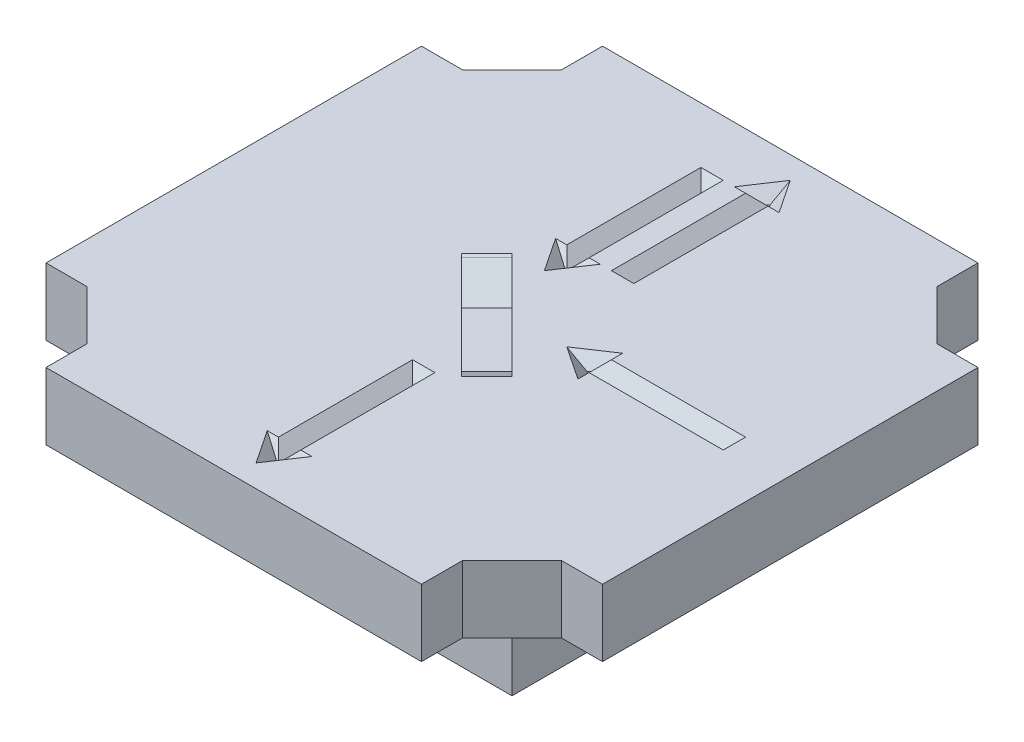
ISO-10303-21;
HEADER;
FILE_DESCRIPTION(('STEP AP214'),'2;1');
FILE_NAME('part.step','',(''),(''),'','','');
FILE_SCHEMA(('AUTOMOTIVE_DESIGN { 1 0 10303 214 1 1 1 1 }'));
ENDSEC;
DATA;
#1=APPLICATION_CONTEXT('core data for automotive mechanical design processes');
#2=APPLICATION_PROTOCOL_DEFINITION('international standard','automotive_design',2000,#1);
#3=PRODUCT_CONTEXT('',#1,'mechanical');
#4=PRODUCT('Part','Part','',(#3));
#5=PRODUCT_RELATED_PRODUCT_CATEGORY('part','',(#4));
#6=PRODUCT_DEFINITION_FORMATION('','',#4);
#7=PRODUCT_DEFINITION_CONTEXT('part definition',#1,'design');
#8=PRODUCT_DEFINITION('design','',#6,#7);
#9=PRODUCT_DEFINITION_SHAPE('','',#8);
#10=(LENGTH_UNIT() NAMED_UNIT(*) SI_UNIT(.MILLI.,.METRE.));
#11=(NAMED_UNIT(*) PLANE_ANGLE_UNIT() SI_UNIT($,.RADIAN.));
#12=(NAMED_UNIT(*) SI_UNIT($,.STERADIAN.) SOLID_ANGLE_UNIT());
#13=UNCERTAINTY_MEASURE_WITH_UNIT(LENGTH_MEASURE(1.E-05),#10,'distance_accuracy_value','');
#14=(GEOMETRIC_REPRESENTATION_CONTEXT(3) GLOBAL_UNCERTAINTY_ASSIGNED_CONTEXT((#13)) GLOBAL_UNIT_ASSIGNED_CONTEXT((#10,
#11,#12)) REPRESENTATION_CONTEXT('',''));
#15=CARTESIAN_POINT('',(0.,0.,0.));
#16=DIRECTION('',(0.,0.,1.));
#17=DIRECTION('',(1.,0.,0.));
#18=AXIS2_PLACEMENT_3D('',#15,#16,#17);
#19=CARTESIAN_POINT('',(0.,6.,0.));
#20=DIRECTION('',(0.,-1.,0.));
#21=DIRECTION('',(0.,0.,-1.));
#22=AXIS2_PLACEMENT_3D('',#19,#20,#21);
#23=PLANE('',#22);
#24=DIRECTION('',(0.,0.,1.));
#25=VECTOR('',#24,1.);
#26=CARTESIAN_POINT('',(-1.,6.,0.));
#27=LINE('',#26,#25);
#28=CARTESIAN_POINT('',(-0.999999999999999,6.,7.9));
#29=VERTEX_POINT('',#28);
#30=CARTESIAN_POINT('',(-0.999999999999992,6.,19.9));
#31=VERTEX_POINT('',#30);
#32=EDGE_CURVE('E875',#29,#31,#27,.T.);
#33=ORIENTED_EDGE('',*,*,#32,.F.);
#34=DIRECTION('',(-1.,0.,0.));
#35=VECTOR('',#34,1.);
#36=CARTESIAN_POINT('',(0.,6.,7.89999999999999));
#37=LINE('',#36,#35);
#38=CARTESIAN_POINT('',(1.,6.,7.89999999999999));
#39=VERTEX_POINT('',#38);
#40=EDGE_CURVE('E598',#39,#29,#37,.T.);
#41=ORIENTED_EDGE('',*,*,#40,.F.);
#42=DIRECTION('',(0.,0.,1.));
#43=VECTOR('',#42,1.);
#44=CARTESIAN_POINT('',(1.,6.,0.));
#45=LINE('',#44,#43);
#46=CARTESIAN_POINT('',(1.,6.,19.9));
#47=VERTEX_POINT('',#46);
#48=EDGE_CURVE('E857',#39,#47,#45,.T.);
#49=ORIENTED_EDGE('',*,*,#48,.T.);
#50=DIRECTION('',(1.,0.,0.));
#51=VECTOR('',#50,1.);
#52=CARTESIAN_POINT('',(0.,6.,19.9));
#53=LINE('',#52,#51);
#54=CARTESIAN_POINT('',(2.00000000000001,6.,19.9));
#55=VERTEX_POINT('',#54);
#56=EDGE_CURVE('E862',#47,#55,#53,.T.);
#57=ORIENTED_EDGE('',*,*,#56,.T.);
#58=DIRECTION('',(-0.554700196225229,0.,0.832050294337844));
#59=VECTOR('',#58,1.);
#60=CARTESIAN_POINT('',(10.5692307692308,6.,7.04615384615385));
#61=LINE('',#60,#59);
#62=CARTESIAN_POINT('',(0.,6.,22.9));
#63=VERTEX_POINT('',#62);
#64=EDGE_CURVE('E863',#55,#63,#61,.T.);
#65=ORIENTED_EDGE('',*,*,#64,.T.);
#66=DIRECTION('',(-0.554700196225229,0.,-0.832050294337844));
#67=VECTOR('',#66,1.);
#68=CARTESIAN_POINT('',(-10.5692307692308,6.,7.04615384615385));
#69=LINE('',#68,#67);
#70=CARTESIAN_POINT('',(-1.99999999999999,6.,19.9));
#71=VERTEX_POINT('',#70);
#72=EDGE_CURVE('E867',#63,#71,#69,.T.);
#73=ORIENTED_EDGE('',*,*,#72,.T.);
#74=EDGE_CURVE('E871',#71,#31,#53,.T.);
#75=ORIENTED_EDGE('',*,*,#74,.T.);
#76=EDGE_LOOP('',(#33,#41,#49,#57,#65,#73,#75));
#77=FACE_BOUND('',#76,.T.);
#78=DIRECTION('',(0.,0.,1.));
#79=VECTOR('',#78,1.);
#80=CARTESIAN_POINT('',(7.9,6.,0.));
#81=LINE('',#80,#79);
#82=CARTESIAN_POINT('',(7.9,6.,-2.));
#83=VERTEX_POINT('',#82);
#84=CARTESIAN_POINT('',(7.9,6.,-0.999999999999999));
#85=VERTEX_POINT('',#84);
#86=EDGE_CURVE('E900',#83,#85,#81,.T.);
#87=ORIENTED_EDGE('',*,*,#86,.T.);
#88=DIRECTION('',(-1.,0.,0.));
#89=VECTOR('',#88,1.);
#90=CARTESIAN_POINT('',(0.,6.,-0.999999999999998));
#91=LINE('',#90,#89);
#92=CARTESIAN_POINT('',(19.9,6.,-0.999999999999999));
#93=VERTEX_POINT('',#92);
#94=EDGE_CURVE('E861',#93,#85,#91,.T.);
#95=ORIENTED_EDGE('',*,*,#94,.F.);
#96=DIRECTION('',(0.,0.,1.));
#97=VECTOR('',#96,1.);
#98=CARTESIAN_POINT('',(19.9,6.,0.));
#99=LINE('',#98,#97);
#100=CARTESIAN_POINT('',(19.9,6.,1.));
#101=VERTEX_POINT('',#100);
#102=EDGE_CURVE('E882',#93,#101,#99,.T.);
#103=ORIENTED_EDGE('',*,*,#102,.T.);
#104=DIRECTION('',(-1.,0.,0.));
#105=VECTOR('',#104,1.);
#106=CARTESIAN_POINT('',(0.,6.,1.));
#107=LINE('',#106,#105);
#108=CARTESIAN_POINT('',(7.9,6.,1.));
#109=VERTEX_POINT('',#108);
#110=EDGE_CURVE('E887',#101,#109,#107,.T.);
#111=ORIENTED_EDGE('',*,*,#110,.T.);
#112=CARTESIAN_POINT('',(7.9,6.,2.));
#113=VERTEX_POINT('',#112);
#114=EDGE_CURVE('E891',#109,#113,#81,.T.);
#115=ORIENTED_EDGE('',*,*,#114,.T.);
#116=DIRECTION('',(-0.832050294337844,0.,-0.554700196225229));
#117=VECTOR('',#116,1.);
#118=CARTESIAN_POINT('',(1.50769230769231,6.,-2.26153846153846));
#119=LINE('',#118,#117);
#120=CARTESIAN_POINT('',(4.9,6.,0.));
#121=VERTEX_POINT('',#120);
#122=EDGE_CURVE('E892',#113,#121,#119,.T.);
#123=ORIENTED_EDGE('',*,*,#122,.T.);
#124=DIRECTION('',(0.832050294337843,0.,-0.554700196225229));
#125=VECTOR('',#124,1.);
#126=CARTESIAN_POINT('',(1.50769230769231,6.,2.26153846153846));
#127=LINE('',#126,#125);
#128=EDGE_CURVE('E896',#121,#83,#127,.T.);
#129=ORIENTED_EDGE('',*,*,#128,.T.);
#130=EDGE_LOOP('',(#87,#95,#103,#111,#115,#123,#129));
#131=FACE_BOUND('',#130,.T.);
#132=DIRECTION('',(0.,0.,1.));
#133=VECTOR('',#132,1.);
#134=CARTESIAN_POINT('',(-3.,6.,0.));
#135=LINE('',#134,#133);
#136=CARTESIAN_POINT('',(-3.,6.,-19.9));
#137=VERTEX_POINT('',#136);
#138=CARTESIAN_POINT('',(-3.,6.,-7.9));
#139=VERTEX_POINT('',#138);
#140=EDGE_CURVE('E918',#137,#139,#135,.T.);
#141=ORIENTED_EDGE('',*,*,#140,.F.);
#142=DIRECTION('',(-1.,0.,0.));
#143=VECTOR('',#142,1.);
#144=CARTESIAN_POINT('',(0.,6.,-19.9));
#145=LINE('',#144,#143);
#146=CARTESIAN_POINT('',(-1.,6.,-19.9));
#147=VERTEX_POINT('',#146);
#148=EDGE_CURVE('E886',#147,#137,#145,.T.);
#149=ORIENTED_EDGE('',*,*,#148,.F.);
#150=DIRECTION('',(0.,0.,1.));
#151=VECTOR('',#150,1.);
#152=CARTESIAN_POINT('',(-0.999999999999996,6.,0.));
#153=LINE('',#152,#151);
#154=CARTESIAN_POINT('',(-0.999999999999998,6.,-7.9));
#155=VERTEX_POINT('',#154);
#156=EDGE_CURVE('E850',#147,#155,#153,.T.);
#157=ORIENTED_EDGE('',*,*,#156,.T.);
#158=DIRECTION('',(1.,0.,0.));
#159=VECTOR('',#158,1.);
#160=CARTESIAN_POINT('',(0.,6.,-7.9));
#161=LINE('',#160,#159);
#162=CARTESIAN_POINT('',(0.,6.,-7.9));
#163=VERTEX_POINT('',#162);
#164=EDGE_CURVE('E854',#155,#163,#161,.T.);
#165=ORIENTED_EDGE('',*,*,#164,.T.);
#166=DIRECTION('',(-0.554700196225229,0.,0.832050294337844));
#167=VECTOR('',#166,1.);
#168=CARTESIAN_POINT('',(-3.64615384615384,6.,-2.43076923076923));
#169=LINE('',#168,#167);
#170=CARTESIAN_POINT('',(-2.,6.,-4.9));
#171=VERTEX_POINT('',#170);
#172=EDGE_CURVE('E906',#163,#171,#169,.T.);
#173=ORIENTED_EDGE('',*,*,#172,.T.);
#174=DIRECTION('',(-0.554700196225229,0.,-0.832050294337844));
#175=VECTOR('',#174,1.);
#176=CARTESIAN_POINT('',(0.876923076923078,6.,-0.584615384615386));
#177=LINE('',#176,#175);
#178=CARTESIAN_POINT('',(-4.,6.,-7.9));
#179=VERTEX_POINT('',#178);
#180=EDGE_CURVE('E910',#171,#179,#177,.T.);
#181=ORIENTED_EDGE('',*,*,#180,.T.);
#182=EDGE_CURVE('E914',#179,#139,#161,.T.);
#183=ORIENTED_EDGE('',*,*,#182,.T.);
#184=EDGE_LOOP('',(#141,#149,#157,#165,#173,#181,#183));
#185=FACE_BOUND('',#184,.T.);
#186=DIRECTION('',(0.707106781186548,0.,0.707106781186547));
#187=VECTOR('',#186,1.);
#188=CARTESIAN_POINT('',(-2.26274169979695,6.,2.26274169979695));
#189=LINE('',#188,#187);
#190=CARTESIAN_POINT('',(-7.02771809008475,6.,-2.50223469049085));
#191=VERTEX_POINT('',#190);
#192=CARTESIAN_POINT('',(2.50223469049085,6.,7.02771809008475));
#193=VERTEX_POINT('',#192);
#194=EDGE_CURVE('E505',#191,#193,#189,.T.);
#195=ORIENTED_EDGE('',*,*,#194,.F.);
#196=DIRECTION('',(0.707106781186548,0.,-0.707106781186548));
#197=VECTOR('',#196,1.);
#198=CARTESIAN_POINT('',(-7.02771809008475,6.,-2.50223469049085));
#199=LINE('',#198,#197);
#200=CARTESIAN_POINT('',(-4.7649763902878,6.,-4.7649763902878));
#201=VERTEX_POINT('',#200);
#202=EDGE_CURVE('E501',#191,#201,#199,.T.);
#203=ORIENTED_EDGE('',*,*,#202,.T.);
#204=DIRECTION('',(0.707106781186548,0.,0.707106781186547));
#205=VECTOR('',#204,1.);
#206=CARTESIAN_POINT('',(0.,6.,0.));
#207=LINE('',#206,#205);
#208=CARTESIAN_POINT('',(4.7649763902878,6.,4.76497639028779));
#209=VERTEX_POINT('',#208);
#210=EDGE_CURVE('E493',#201,#209,#207,.T.);
#211=ORIENTED_EDGE('',*,*,#210,.T.);
#212=DIRECTION('',(0.707106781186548,0.,-0.707106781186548));
#213=VECTOR('',#212,1.);
#214=CARTESIAN_POINT('',(2.50223469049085,6.,7.02771809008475));
#215=LINE('',#214,#213);
#216=EDGE_CURVE('E497',#209,#193,#215,.F.);
#217=ORIENTED_EDGE('',*,*,#216,.T.);
#218=EDGE_LOOP('',(#195,#203,#211,#217));
#219=FACE_BOUND('',#218,.T.);
#220=DIRECTION('',(0.,0.,1.));
#221=VECTOR('',#220,1.);
#222=CARTESIAN_POINT('',(-24.9,6.,0.));
#223=LINE('',#222,#221);
#224=CARTESIAN_POINT('',(-24.9,6.,-16.7993694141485));
#225=VERTEX_POINT('',#224);
#226=CARTESIAN_POINT('',(-24.9,6.,16.7993694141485));
#227=VERTEX_POINT('',#226);
#228=EDGE_CURVE('E242',#225,#227,#223,.T.);
#229=ORIENTED_EDGE('',*,*,#228,.T.);
#230=DIRECTION('',(-1.,0.,0.));
#231=VECTOR('',#230,1.);
#232=CARTESIAN_POINT('',(0.,6.,16.7993694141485));
#233=LINE('',#232,#231);
#234=CARTESIAN_POINT('',(-21.24,6.,16.7993694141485));
#235=VERTEX_POINT('',#234);
#236=EDGE_CURVE('E257',#235,#227,#233,.T.);
#237=ORIENTED_EDGE('',*,*,#236,.F.);
#238=DIRECTION('',(-0.707106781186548,0.,-0.707106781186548));
#239=VECTOR('',#238,1.);
#240=CARTESIAN_POINT('',(-19.0196847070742,6.,19.0196847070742));
#241=LINE('',#240,#239);
#242=CARTESIAN_POINT('',(-16.7993694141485,6.,21.24));
#243=VERTEX_POINT('',#242);
#244=EDGE_CURVE('E261',#243,#235,#241,.T.);
#245=ORIENTED_EDGE('',*,*,#244,.F.);
#246=DIRECTION('',(0.,0.,-1.));
#247=VECTOR('',#246,1.);
#248=CARTESIAN_POINT('',(-16.7993694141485,6.,0.));
#249=LINE('',#248,#247);
#250=CARTESIAN_POINT('',(-16.7993694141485,6.,24.9));
#251=VERTEX_POINT('',#250);
#252=EDGE_CURVE('E265',#251,#243,#249,.T.);
#253=ORIENTED_EDGE('',*,*,#252,.F.);
#254=DIRECTION('',(-1.,0.,0.));
#255=VECTOR('',#254,1.);
#256=CARTESIAN_POINT('',(0.,6.,24.9));
#257=LINE('',#256,#255);
#258=CARTESIAN_POINT('',(16.7993694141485,6.,24.9));
#259=VERTEX_POINT('',#258);
#260=EDGE_CURVE('E269',#259,#251,#257,.T.);
#261=ORIENTED_EDGE('',*,*,#260,.F.);
#262=DIRECTION('',(0.,0.,1.));
#263=VECTOR('',#262,1.);
#264=CARTESIAN_POINT('',(16.7993694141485,6.,0.));
#265=LINE('',#264,#263);
#266=CARTESIAN_POINT('',(16.7993694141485,6.,21.24));
#267=VERTEX_POINT('',#266);
#268=EDGE_CURVE('E273',#267,#259,#265,.T.);
#269=ORIENTED_EDGE('',*,*,#268,.F.);
#270=DIRECTION('',(-0.707106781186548,0.,0.707106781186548));
#271=VECTOR('',#270,1.);
#272=CARTESIAN_POINT('',(19.0196847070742,6.,19.0196847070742));
#273=LINE('',#272,#271);
#274=CARTESIAN_POINT('',(21.24,6.,16.7993694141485));
#275=VERTEX_POINT('',#274);
#276=EDGE_CURVE('E277',#275,#267,#273,.T.);
#277=ORIENTED_EDGE('',*,*,#276,.F.);
#278=DIRECTION('',(-1.,0.,0.));
#279=VECTOR('',#278,1.);
#280=CARTESIAN_POINT('',(0.,6.,16.7993694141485));
#281=LINE('',#280,#279);
#282=CARTESIAN_POINT('',(24.9,6.,16.7993694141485));
#283=VERTEX_POINT('',#282);
#284=EDGE_CURVE('E281',#283,#275,#281,.T.);
#285=ORIENTED_EDGE('',*,*,#284,.F.);
#286=DIRECTION('',(0.,0.,1.));
#287=VECTOR('',#286,1.);
#288=CARTESIAN_POINT('',(24.9,6.,0.));
#289=LINE('',#288,#287);
#290=CARTESIAN_POINT('',(24.9,6.,-16.7993694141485));
#291=VERTEX_POINT('',#290);
#292=EDGE_CURVE('E285',#291,#283,#289,.T.);
#293=ORIENTED_EDGE('',*,*,#292,.F.);
#294=DIRECTION('',(1.,0.,0.));
#295=VECTOR('',#294,1.);
#296=CARTESIAN_POINT('',(0.,6.,-16.7993694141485));
#297=LINE('',#296,#295);
#298=CARTESIAN_POINT('',(21.24,6.,-16.7993694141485));
#299=VERTEX_POINT('',#298);
#300=EDGE_CURVE('E289',#299,#291,#297,.T.);
#301=ORIENTED_EDGE('',*,*,#300,.F.);
#302=DIRECTION('',(0.707106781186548,0.,0.707106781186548));
#303=VECTOR('',#302,1.);
#304=CARTESIAN_POINT('',(19.0196847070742,6.,-19.0196847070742));
#305=LINE('',#304,#303);
#306=CARTESIAN_POINT('',(16.7993694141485,6.,-21.24));
#307=VERTEX_POINT('',#306);
#308=EDGE_CURVE('E293',#307,#299,#305,.T.);
#309=ORIENTED_EDGE('',*,*,#308,.F.);
#310=DIRECTION('',(0.,0.,1.));
#311=VECTOR('',#310,1.);
#312=CARTESIAN_POINT('',(16.7993694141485,6.,0.));
#313=LINE('',#312,#311);
#314=CARTESIAN_POINT('',(16.7993694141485,6.,-24.9));
#315=VERTEX_POINT('',#314);
#316=EDGE_CURVE('E297',#315,#307,#313,.T.);
#317=ORIENTED_EDGE('',*,*,#316,.F.);
#318=DIRECTION('',(-1.,0.,0.));
#319=VECTOR('',#318,1.);
#320=CARTESIAN_POINT('',(0.,6.,-24.9));
#321=LINE('',#320,#319);
#322=CARTESIAN_POINT('',(-16.7993694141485,6.,-24.9));
#323=VERTEX_POINT('',#322);
#324=EDGE_CURVE('E301',#315,#323,#321,.T.);
#325=ORIENTED_EDGE('',*,*,#324,.T.);
#326=DIRECTION('',(0.,0.,-1.));
#327=VECTOR('',#326,1.);
#328=CARTESIAN_POINT('',(-16.7993694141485,6.,0.));
#329=LINE('',#328,#327);
#330=CARTESIAN_POINT('',(-16.7993694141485,6.,-21.24));
#331=VERTEX_POINT('',#330);
#332=EDGE_CURVE('E305',#331,#323,#329,.T.);
#333=ORIENTED_EDGE('',*,*,#332,.F.);
#334=DIRECTION('',(0.707106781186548,0.,-0.707106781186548));
#335=VECTOR('',#334,1.);
#336=CARTESIAN_POINT('',(-19.0196847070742,6.,-19.0196847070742));
#337=LINE('',#336,#335);
#338=CARTESIAN_POINT('',(-21.24,6.,-16.7993694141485));
#339=VERTEX_POINT('',#338);
#340=EDGE_CURVE('E309',#339,#331,#337,.T.);
#341=ORIENTED_EDGE('',*,*,#340,.F.);
#342=DIRECTION('',(1.,0.,0.));
#343=VECTOR('',#342,1.);
#344=CARTESIAN_POINT('',(0.,6.,-16.7993694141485));
#345=LINE('',#344,#343);
#346=EDGE_CURVE('E313',#225,#339,#345,.T.);
#347=ORIENTED_EDGE('',*,*,#346,.F.);
#348=EDGE_LOOP('',(#229,#237,#245,#253,#261,#269,#277,#285,#293,#301,#309,#317,#325,#333,#341,#347));
#349=FACE_BOUND('',#348,.T.);
#350=DIRECTION('',(0.554700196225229,0.,0.832050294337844));
#351=VECTOR('',#350,1.);
#352=CARTESIAN_POINT('',(11.9538461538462,6.,-7.96923076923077));
#353=LINE('',#352,#351);
#354=CARTESIAN_POINT('',(2.,6.,-22.9));
#355=VERTEX_POINT('',#354);
#356=CARTESIAN_POINT('',(4.,6.,-19.9));
#357=VERTEX_POINT('',#356);
#358=EDGE_CURVE('E189',#355,#357,#353,.T.);
#359=ORIENTED_EDGE('',*,*,#358,.T.);
#360=DIRECTION('',(-1.,0.,0.));
#361=VECTOR('',#360,1.);
#362=CARTESIAN_POINT('',(0.,6.,-19.9));
#363=LINE('',#362,#361);
#364=CARTESIAN_POINT('',(3.,6.,-19.9));
#365=VERTEX_POINT('',#364);
#366=EDGE_CURVE('E185',#357,#365,#363,.T.);
#367=ORIENTED_EDGE('',*,*,#366,.T.);
#368=DIRECTION('',(0.,0.,-1.));
#369=VECTOR('',#368,1.);
#370=CARTESIAN_POINT('',(3.,6.,0.));
#371=LINE('',#370,#369);
#372=CARTESIAN_POINT('',(3.,6.,-7.9));
#373=VERTEX_POINT('',#372);
#374=EDGE_CURVE('E194',#373,#365,#371,.T.);
#375=ORIENTED_EDGE('',*,*,#374,.F.);
#376=DIRECTION('',(1.,0.,0.));
#377=VECTOR('',#376,1.);
#378=CARTESIAN_POINT('',(0.,6.,-7.9));
#379=LINE('',#378,#377);
#380=CARTESIAN_POINT('',(1.,6.,-7.9));
#381=VERTEX_POINT('',#380);
#382=EDGE_CURVE('E148',#381,#373,#379,.T.);
#383=ORIENTED_EDGE('',*,*,#382,.F.);
#384=DIRECTION('',(0.,0.,-1.));
#385=VECTOR('',#384,1.);
#386=CARTESIAN_POINT('',(1.,6.,0.));
#387=LINE('',#386,#385);
#388=CARTESIAN_POINT('',(1.,6.,-19.9));
#389=VERTEX_POINT('',#388);
#390=EDGE_CURVE('E138',#381,#389,#387,.T.);
#391=ORIENTED_EDGE('',*,*,#390,.T.);
#392=CARTESIAN_POINT('',(0.,6.,-19.9));
#393=VERTEX_POINT('',#392);
#394=EDGE_CURVE('E178',#389,#393,#363,.T.);
#395=ORIENTED_EDGE('',*,*,#394,.T.);
#396=DIRECTION('',(0.554700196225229,0.,-0.832050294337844));
#397=VECTOR('',#396,1.);
#398=CARTESIAN_POINT('',(-9.18461538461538,6.,-6.12307692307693));
#399=LINE('',#398,#397);
#400=EDGE_CURVE('E183',#393,#355,#399,.T.);
#401=ORIENTED_EDGE('',*,*,#400,.T.);
#402=EDGE_LOOP('',(#359,#367,#375,#383,#391,#395,#401));
#403=FACE_BOUND('',#402,.T.);
#404=ADVANCED_FACE('F85',(#77,#131,#185,#219,#349,#403),#23,.F.);
#405=CARTESIAN_POINT('',(-19.0196847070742,2.,19.0196847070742));
#406=DIRECTION('',(0.707106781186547,0.,-0.707106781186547));
#407=DIRECTION('',(-0.707106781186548,0.,-0.707106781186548));
#408=AXIS2_PLACEMENT_3D('',#405,#406,#407);
#409=PLANE('',#408);
#410=DIRECTION('',(0.707106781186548,0.,0.707106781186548));
#411=VECTOR('',#410,1.);
#412=CARTESIAN_POINT('',(-19.0196847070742,0.,19.0196847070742));
#413=LINE('',#412,#411);
#414=CARTESIAN_POINT('',(-21.24,0.,16.7993694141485));
#415=VERTEX_POINT('',#414);
#416=CARTESIAN_POINT('',(-16.7993694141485,0.,21.24));
#417=VERTEX_POINT('',#416);
#418=EDGE_CURVE('E354',#415,#417,#413,.T.);
#419=ORIENTED_EDGE('',*,*,#418,.T.);
#420=DIRECTION('',(0.,-1.,0.));
#421=VECTOR('',#420,1.);
#422=CARTESIAN_POINT('',(-16.7993694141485,2.,21.24));
#423=LINE('',#422,#421);
#424=EDGE_CURVE('E489',#243,#417,#423,.T.);
#425=ORIENTED_EDGE('',*,*,#424,.F.);
#426=ORIENTED_EDGE('',*,*,#244,.T.);
#427=DIRECTION('',(0.,-1.,0.));
#428=VECTOR('',#427,1.);
#429=CARTESIAN_POINT('',(-21.24,2.,16.7993694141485));
#430=LINE('',#429,#428);
#431=EDGE_CURVE('E429',#235,#415,#430,.T.);
#432=ORIENTED_EDGE('',*,*,#431,.T.);
#433=EDGE_LOOP('',(#419,#425,#426,#432));
#434=FACE_BOUND('',#433,.T.);
#435=ADVANCED_FACE('F965',(#434),#409,.F.);
#436=CARTESIAN_POINT('',(-16.7993694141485,2.,0.));
#437=DIRECTION('',(1.,0.,0.));
#438=DIRECTION('',(0.,0.,-1.));
#439=AXIS2_PLACEMENT_3D('',#436,#437,#438);
#440=PLANE('',#439);
#441=DIRECTION('',(0.,0.,1.));
#442=VECTOR('',#441,1.);
#443=CARTESIAN_POINT('',(-16.7993694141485,0.,0.));
#444=LINE('',#443,#442);
#445=CARTESIAN_POINT('',(-16.7993694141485,0.,24.9));
#446=VERTEX_POINT('',#445);
#447=EDGE_CURVE('E369',#417,#446,#444,.T.);
#448=ORIENTED_EDGE('',*,*,#447,.T.);
#449=DIRECTION('',(0.,-1.,0.));
#450=VECTOR('',#449,1.);
#451=CARTESIAN_POINT('',(-16.7993694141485,2.,24.9));
#452=LINE('',#451,#450);
#453=EDGE_CURVE('E485',#251,#446,#452,.T.);
#454=ORIENTED_EDGE('',*,*,#453,.F.);
#455=ORIENTED_EDGE('',*,*,#252,.T.);
#456=ORIENTED_EDGE('',*,*,#424,.T.);
#457=EDGE_LOOP('',(#448,#454,#455,#456));
#458=FACE_BOUND('',#457,.T.);
#459=ADVANCED_FACE('F971',(#458),#440,.F.);
#460=CARTESIAN_POINT('',(0.,2.,24.9));
#461=DIRECTION('',(0.,0.,-1.));
#462=DIRECTION('',(-1.,0.,0.));
#463=AXIS2_PLACEMENT_3D('',#460,#461,#462);
#464=PLANE('',#463);
#465=DIRECTION('',(1.,0.,0.));
#466=VECTOR('',#465,1.);
#467=CARTESIAN_POINT('',(0.,0.,24.9));
#468=LINE('',#467,#466);
#469=CARTESIAN_POINT('',(16.7993694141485,0.,24.9));
#470=VERTEX_POINT('',#469);
#471=EDGE_CURVE('E373',#446,#470,#468,.T.);
#472=ORIENTED_EDGE('',*,*,#471,.T.);
#473=DIRECTION('',(0.,-1.,0.));
#474=VECTOR('',#473,1.);
#475=CARTESIAN_POINT('',(16.7993694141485,2.,24.9));
#476=LINE('',#475,#474);
#477=EDGE_CURVE('E481',#259,#470,#476,.T.);
#478=ORIENTED_EDGE('',*,*,#477,.F.);
#479=ORIENTED_EDGE('',*,*,#260,.T.);
#480=ORIENTED_EDGE('',*,*,#453,.T.);
#481=EDGE_LOOP('',(#472,#478,#479,#480));
#482=FACE_BOUND('',#481,.T.);
#483=ADVANCED_FACE('F1055',(#482),#464,.F.);
#484=CARTESIAN_POINT('',(16.7993694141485,2.,0.));
#485=DIRECTION('',(-1.,0.,0.));
#486=DIRECTION('',(0.,0.,1.));
#487=AXIS2_PLACEMENT_3D('',#484,#485,#486);
#488=PLANE('',#487);
#489=DIRECTION('',(0.,0.,-1.));
#490=VECTOR('',#489,1.);
#491=CARTESIAN_POINT('',(16.7993694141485,0.,0.));
#492=LINE('',#491,#490);
#493=CARTESIAN_POINT('',(16.7993694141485,0.,21.24));
#494=VERTEX_POINT('',#493);
#495=EDGE_CURVE('E377',#470,#494,#492,.T.);
#496=ORIENTED_EDGE('',*,*,#495,.T.);
#497=DIRECTION('',(0.,-1.,0.));
#498=VECTOR('',#497,1.);
#499=CARTESIAN_POINT('',(16.7993694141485,2.,21.24));
#500=LINE('',#499,#498);
#501=EDGE_CURVE('E477',#267,#494,#500,.T.);
#502=ORIENTED_EDGE('',*,*,#501,.F.);
#503=ORIENTED_EDGE('',*,*,#268,.T.);
#504=ORIENTED_EDGE('',*,*,#477,.T.);
#505=EDGE_LOOP('',(#496,#502,#503,#504));
#506=FACE_BOUND('',#505,.T.);
#507=ADVANCED_FACE('F1051',(#506),#488,.F.);
#508=CARTESIAN_POINT('',(19.0196847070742,2.,19.0196847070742));
#509=DIRECTION('',(-0.707106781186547,0.,-0.707106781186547));
#510=DIRECTION('',(-0.707106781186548,0.,0.707106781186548));
#511=AXIS2_PLACEMENT_3D('',#508,#509,#510);
#512=PLANE('',#511);
#513=DIRECTION('',(0.707106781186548,0.,-0.707106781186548));
#514=VECTOR('',#513,1.);
#515=CARTESIAN_POINT('',(19.0196847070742,0.,19.0196847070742));
#516=LINE('',#515,#514);
#517=CARTESIAN_POINT('',(21.24,0.,16.7993694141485));
#518=VERTEX_POINT('',#517);
#519=EDGE_CURVE('E381',#494,#518,#516,.T.);
#520=ORIENTED_EDGE('',*,*,#519,.T.);
#521=DIRECTION('',(0.,-1.,0.));
#522=VECTOR('',#521,1.);
#523=CARTESIAN_POINT('',(21.24,2.,16.7993694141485));
#524=LINE('',#523,#522);
#525=EDGE_CURVE('E473',#275,#518,#524,.T.);
#526=ORIENTED_EDGE('',*,*,#525,.F.);
#527=ORIENTED_EDGE('',*,*,#276,.T.);
#528=ORIENTED_EDGE('',*,*,#501,.T.);
#529=EDGE_LOOP('',(#520,#526,#527,#528));
#530=FACE_BOUND('',#529,.T.);
#531=ADVANCED_FACE('F1047',(#530),#512,.F.);
#532=CARTESIAN_POINT('',(0.,2.,16.7993694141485));
#533=DIRECTION('',(0.,0.,-1.));
#534=DIRECTION('',(-1.,0.,0.));
#535=AXIS2_PLACEMENT_3D('',#532,#533,#534);
#536=PLANE('',#535);
#537=DIRECTION('',(1.,0.,0.));
#538=VECTOR('',#537,1.);
#539=CARTESIAN_POINT('',(0.,0.,16.7993694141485));
#540=LINE('',#539,#538);
#541=CARTESIAN_POINT('',(24.9,0.,16.7993694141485));
#542=VERTEX_POINT('',#541);
#543=EDGE_CURVE('E385',#518,#542,#540,.T.);
#544=ORIENTED_EDGE('',*,*,#543,.T.);
#545=DIRECTION('',(0.,-1.,0.));
#546=VECTOR('',#545,1.);
#547=CARTESIAN_POINT('',(24.9,2.,16.7993694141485));
#548=LINE('',#547,#546);
#549=EDGE_CURVE('E469',#283,#542,#548,.T.);
#550=ORIENTED_EDGE('',*,*,#549,.F.);
#551=ORIENTED_EDGE('',*,*,#284,.T.);
#552=ORIENTED_EDGE('',*,*,#525,.T.);
#553=EDGE_LOOP('',(#544,#550,#551,#552));
#554=FACE_BOUND('',#553,.T.);
#555=ADVANCED_FACE('F1043',(#554),#536,.F.);
#556=CARTESIAN_POINT('',(24.9,2.,0.));
#557=DIRECTION('',(-1.,0.,0.));
#558=DIRECTION('',(0.,0.,1.));
#559=AXIS2_PLACEMENT_3D('',#556,#557,#558);
#560=PLANE('',#559);
#561=DIRECTION('',(0.,0.,-1.));
#562=VECTOR('',#561,1.);
#563=CARTESIAN_POINT('',(24.9,0.,0.));
#564=LINE('',#563,#562);
#565=CARTESIAN_POINT('',(24.9,0.,-16.7993694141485));
#566=VERTEX_POINT('',#565);
#567=EDGE_CURVE('E389',#542,#566,#564,.T.);
#568=ORIENTED_EDGE('',*,*,#567,.T.);
#569=DIRECTION('',(0.,-1.,0.));
#570=VECTOR('',#569,1.);
#571=CARTESIAN_POINT('',(24.9,2.,-16.7993694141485));
#572=LINE('',#571,#570);
#573=EDGE_CURVE('E465',#291,#566,#572,.T.);
#574=ORIENTED_EDGE('',*,*,#573,.F.);
#575=ORIENTED_EDGE('',*,*,#292,.T.);
#576=ORIENTED_EDGE('',*,*,#549,.T.);
#577=EDGE_LOOP('',(#568,#574,#575,#576));
#578=FACE_BOUND('',#577,.T.);
#579=ADVANCED_FACE('F1039',(#578),#560,.F.);
#580=CARTESIAN_POINT('',(0.,2.,-16.7993694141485));
#581=DIRECTION('',(0.,0.,1.));
#582=DIRECTION('',(1.,0.,0.));
#583=AXIS2_PLACEMENT_3D('',#580,#581,#582);
#584=PLANE('',#583);
#585=DIRECTION('',(-1.,0.,0.));
#586=VECTOR('',#585,1.);
#587=CARTESIAN_POINT('',(0.,0.,-16.7993694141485));
#588=LINE('',#587,#586);
#589=CARTESIAN_POINT('',(21.24,0.,-16.7993694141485));
#590=VERTEX_POINT('',#589);
#591=EDGE_CURVE('E393',#566,#590,#588,.T.);
#592=ORIENTED_EDGE('',*,*,#591,.T.);
#593=DIRECTION('',(0.,-1.,0.));
#594=VECTOR('',#593,1.);
#595=CARTESIAN_POINT('',(21.24,2.,-16.7993694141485));
#596=LINE('',#595,#594);
#597=EDGE_CURVE('E461',#299,#590,#596,.T.);
#598=ORIENTED_EDGE('',*,*,#597,.F.);
#599=ORIENTED_EDGE('',*,*,#300,.T.);
#600=ORIENTED_EDGE('',*,*,#573,.T.);
#601=EDGE_LOOP('',(#592,#598,#599,#600));
#602=FACE_BOUND('',#601,.T.);
#603=ADVANCED_FACE('F1035',(#602),#584,.F.);
#604=CARTESIAN_POINT('',(19.0196847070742,2.,-19.0196847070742));
#605=DIRECTION('',(-0.707106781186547,0.,0.707106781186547));
#606=DIRECTION('',(0.707106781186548,0.,0.707106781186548));
#607=AXIS2_PLACEMENT_3D('',#604,#605,#606);
#608=PLANE('',#607);
#609=DIRECTION('',(-0.707106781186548,0.,-0.707106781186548));
#610=VECTOR('',#609,1.);
#611=CARTESIAN_POINT('',(19.0196847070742,0.,-19.0196847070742));
#612=LINE('',#611,#610);
#613=CARTESIAN_POINT('',(16.7993694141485,0.,-21.24));
#614=VERTEX_POINT('',#613);
#615=EDGE_CURVE('E397',#590,#614,#612,.T.);
#616=ORIENTED_EDGE('',*,*,#615,.T.);
#617=DIRECTION('',(0.,-1.,0.));
#618=VECTOR('',#617,1.);
#619=CARTESIAN_POINT('',(16.7993694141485,2.,-21.24));
#620=LINE('',#619,#618);
#621=EDGE_CURVE('E457',#307,#614,#620,.T.);
#622=ORIENTED_EDGE('',*,*,#621,.F.);
#623=ORIENTED_EDGE('',*,*,#308,.T.);
#624=ORIENTED_EDGE('',*,*,#597,.T.);
#625=EDGE_LOOP('',(#616,#622,#623,#624));
#626=FACE_BOUND('',#625,.T.);
#627=ADVANCED_FACE('F1031',(#626),#608,.F.);
#628=CARTESIAN_POINT('',(16.7993694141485,2.,0.));
#629=DIRECTION('',(-1.,0.,0.));
#630=DIRECTION('',(0.,0.,1.));
#631=AXIS2_PLACEMENT_3D('',#628,#629,#630);
#632=PLANE('',#631);
#633=DIRECTION('',(0.,0.,-1.));
#634=VECTOR('',#633,1.);
#635=CARTESIAN_POINT('',(16.7993694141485,0.,0.));
#636=LINE('',#635,#634);
#637=CARTESIAN_POINT('',(16.7993694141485,0.,-24.9));
#638=VERTEX_POINT('',#637);
#639=EDGE_CURVE('E401',#614,#638,#636,.T.);
#640=ORIENTED_EDGE('',*,*,#639,.T.);
#641=DIRECTION('',(0.,-1.,0.));
#642=VECTOR('',#641,1.);
#643=CARTESIAN_POINT('',(16.7993694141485,2.,-24.9));
#644=LINE('',#643,#642);
#645=EDGE_CURVE('E453',#315,#638,#644,.T.);
#646=ORIENTED_EDGE('',*,*,#645,.F.);
#647=ORIENTED_EDGE('',*,*,#316,.T.);
#648=ORIENTED_EDGE('',*,*,#621,.T.);
#649=EDGE_LOOP('',(#640,#646,#647,#648));
#650=FACE_BOUND('',#649,.T.);
#651=ADVANCED_FACE('F1027',(#650),#632,.F.);
#652=CARTESIAN_POINT('',(0.,2.,-24.9));
#653=DIRECTION('',(0.,0.,-1.));
#654=DIRECTION('',(-1.,0.,0.));
#655=AXIS2_PLACEMENT_3D('',#652,#653,#654);
#656=PLANE('',#655);
#657=DIRECTION('',(1.,0.,0.));
#658=VECTOR('',#657,1.);
#659=CARTESIAN_POINT('',(0.,0.,-24.9));
#660=LINE('',#659,#658);
#661=CARTESIAN_POINT('',(-16.7993694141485,0.,-24.9));
#662=VERTEX_POINT('',#661);
#663=EDGE_CURVE('E405',#662,#638,#660,.T.);
#664=ORIENTED_EDGE('',*,*,#663,.F.);
#665=DIRECTION('',(0.,-1.,0.));
#666=VECTOR('',#665,1.);
#667=CARTESIAN_POINT('',(-16.7993694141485,2.,-24.9));
#668=LINE('',#667,#666);
#669=EDGE_CURVE('E449',#323,#662,#668,.T.);
#670=ORIENTED_EDGE('',*,*,#669,.F.);
#671=ORIENTED_EDGE('',*,*,#324,.F.);
#672=ORIENTED_EDGE('',*,*,#645,.T.);
#673=EDGE_LOOP('',(#664,#670,#671,#672));
#674=FACE_BOUND('',#673,.T.);
#675=ADVANCED_FACE('F1023',(#674),#656,.T.);
#676=CARTESIAN_POINT('',(-16.7993694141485,2.,0.));
#677=DIRECTION('',(1.,0.,0.));
#678=DIRECTION('',(0.,0.,-1.));
#679=AXIS2_PLACEMENT_3D('',#676,#677,#678);
#680=PLANE('',#679);
#681=DIRECTION('',(0.,0.,1.));
#682=VECTOR('',#681,1.);
#683=CARTESIAN_POINT('',(-16.7993694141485,0.,0.));
#684=LINE('',#683,#682);
#685=CARTESIAN_POINT('',(-16.7993694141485,0.,-21.24));
#686=VERTEX_POINT('',#685);
#687=EDGE_CURVE('E409',#662,#686,#684,.T.);
#688=ORIENTED_EDGE('',*,*,#687,.T.);
#689=DIRECTION('',(0.,-1.,0.));
#690=VECTOR('',#689,1.);
#691=CARTESIAN_POINT('',(-16.7993694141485,2.,-21.24));
#692=LINE('',#691,#690);
#693=EDGE_CURVE('E445',#331,#686,#692,.T.);
#694=ORIENTED_EDGE('',*,*,#693,.F.);
#695=ORIENTED_EDGE('',*,*,#332,.T.);
#696=ORIENTED_EDGE('',*,*,#669,.T.);
#697=EDGE_LOOP('',(#688,#694,#695,#696));
#698=FACE_BOUND('',#697,.T.);
#699=ADVANCED_FACE('F1019',(#698),#680,.F.);
#700=CARTESIAN_POINT('',(-19.0196847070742,2.,-19.0196847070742));
#701=DIRECTION('',(0.707106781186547,0.,0.707106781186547));
#702=DIRECTION('',(0.707106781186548,0.,-0.707106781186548));
#703=AXIS2_PLACEMENT_3D('',#700,#701,#702);
#704=PLANE('',#703);
#705=DIRECTION('',(-0.707106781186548,0.,0.707106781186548));
#706=VECTOR('',#705,1.);
#707=CARTESIAN_POINT('',(-19.0196847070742,0.,-19.0196847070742));
#708=LINE('',#707,#706);
#709=CARTESIAN_POINT('',(-21.24,0.,-16.7993694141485));
#710=VERTEX_POINT('',#709);
#711=EDGE_CURVE('E413',#686,#710,#708,.T.);
#712=ORIENTED_EDGE('',*,*,#711,.T.);
#713=DIRECTION('',(0.,-1.,0.));
#714=VECTOR('',#713,1.);
#715=CARTESIAN_POINT('',(-21.24,2.,-16.7993694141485));
#716=LINE('',#715,#714);
#717=EDGE_CURVE('E441',#339,#710,#716,.T.);
#718=ORIENTED_EDGE('',*,*,#717,.F.);
#719=ORIENTED_EDGE('',*,*,#340,.T.);
#720=ORIENTED_EDGE('',*,*,#693,.T.);
#721=EDGE_LOOP('',(#712,#718,#719,#720));
#722=FACE_BOUND('',#721,.T.);
#723=ADVANCED_FACE('F1015',(#722),#704,.F.);
#724=CARTESIAN_POINT('',(0.,2.,-16.7993694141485));
#725=DIRECTION('',(0.,0.,1.));
#726=DIRECTION('',(1.,0.,0.));
#727=AXIS2_PLACEMENT_3D('',#724,#725,#726);
#728=PLANE('',#727);
#729=DIRECTION('',(-1.,0.,0.));
#730=VECTOR('',#729,1.);
#731=CARTESIAN_POINT('',(0.,0.,-16.7993694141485));
#732=LINE('',#731,#730);
#733=CARTESIAN_POINT('',(-24.9,0.,-16.7993694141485));
#734=VERTEX_POINT('',#733);
#735=EDGE_CURVE('E417',#710,#734,#732,.T.);
#736=ORIENTED_EDGE('',*,*,#735,.T.);
#737=DIRECTION('',(0.,-1.,0.));
#738=VECTOR('',#737,1.);
#739=CARTESIAN_POINT('',(-24.9,2.,-16.7993694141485));
#740=LINE('',#739,#738);
#741=EDGE_CURVE('E437',#225,#734,#740,.T.);
#742=ORIENTED_EDGE('',*,*,#741,.F.);
#743=ORIENTED_EDGE('',*,*,#346,.T.);
#744=ORIENTED_EDGE('',*,*,#717,.T.);
#745=EDGE_LOOP('',(#736,#742,#743,#744));
#746=FACE_BOUND('',#745,.T.);
#747=ADVANCED_FACE('F1011',(#746),#728,.F.);
#748=CARTESIAN_POINT('',(-24.9,2.,0.));
#749=DIRECTION('',(-1.,0.,0.));
#750=DIRECTION('',(0.,0.,1.));
#751=AXIS2_PLACEMENT_3D('',#748,#749,#750);
#752=PLANE('',#751);
#753=DIRECTION('',(0.,0.,-1.));
#754=VECTOR('',#753,1.);
#755=CARTESIAN_POINT('',(-24.9,0.,0.));
#756=LINE('',#755,#754);
#757=CARTESIAN_POINT('',(-24.9,0.,16.7993694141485));
#758=VERTEX_POINT('',#757);
#759=EDGE_CURVE('E421',#758,#734,#756,.T.);
#760=ORIENTED_EDGE('',*,*,#759,.F.);
#761=DIRECTION('',(0.,-1.,0.));
#762=VECTOR('',#761,1.);
#763=CARTESIAN_POINT('',(-24.9,2.,16.7993694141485));
#764=LINE('',#763,#762);
#765=EDGE_CURVE('E433',#227,#758,#764,.T.);
#766=ORIENTED_EDGE('',*,*,#765,.F.);
#767=ORIENTED_EDGE('',*,*,#228,.F.);
#768=ORIENTED_EDGE('',*,*,#741,.T.);
#769=EDGE_LOOP('',(#760,#766,#767,#768));
#770=FACE_BOUND('',#769,.T.);
#771=ADVANCED_FACE('F1007',(#770),#752,.T.);
#772=CARTESIAN_POINT('',(0.,2.,16.7993694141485));
#773=DIRECTION('',(0.,0.,-1.));
#774=DIRECTION('',(-1.,0.,0.));
#775=AXIS2_PLACEMENT_3D('',#772,#773,#774);
#776=PLANE('',#775);
#777=DIRECTION('',(1.,0.,0.));
#778=VECTOR('',#777,1.);
#779=CARTESIAN_POINT('',(0.,0.,16.7993694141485));
#780=LINE('',#779,#778);
#781=EDGE_CURVE('E425',#758,#415,#780,.T.);
#782=ORIENTED_EDGE('',*,*,#781,.T.);
#783=ORIENTED_EDGE('',*,*,#431,.F.);
#784=ORIENTED_EDGE('',*,*,#236,.T.);
#785=ORIENTED_EDGE('',*,*,#765,.T.);
#786=EDGE_LOOP('',(#782,#783,#784,#785));
#787=FACE_BOUND('',#786,.T.);
#788=ADVANCED_FACE('F1003',(#787),#776,.F.);
#789=CARTESIAN_POINT('',(0.,0.,0.));
#790=DIRECTION('',(0.,1.,0.));
#791=DIRECTION('',(0.,0.,1.));
#792=AXIS2_PLACEMENT_3D('',#789,#790,#791);
#793=PLANE('',#792);
#794=DIRECTION('',(0.,0.,-1.));
#795=VECTOR('',#794,1.);
#796=CARTESIAN_POINT('',(-16.5,0.,16.5));
#797=LINE('',#796,#795);
#798=CARTESIAN_POINT('',(-16.5,0.,16.5));
#799=VERTEX_POINT('',#798);
#800=CARTESIAN_POINT('',(-16.5,0.,-16.5));
#801=VERTEX_POINT('',#800);
#802=EDGE_CURVE('E323',#799,#801,#797,.T.);
#803=ORIENTED_EDGE('',*,*,#802,.F.);
#804=DIRECTION('',(1.,0.,0.));
#805=VECTOR('',#804,1.);
#806=CARTESIAN_POINT('',(-16.5,0.,16.5));
#807=LINE('',#806,#805);
#808=CARTESIAN_POINT('',(16.5,0.,16.5));
#809=VERTEX_POINT('',#808);
#810=EDGE_CURVE('E317',#799,#809,#807,.T.);
#811=ORIENTED_EDGE('',*,*,#810,.T.);
#812=DIRECTION('',(0.,0.,-1.));
#813=VECTOR('',#812,1.);
#814=CARTESIAN_POINT('',(16.5,0.,16.5));
#815=LINE('',#814,#813);
#816=CARTESIAN_POINT('',(16.5,0.,-16.5));
#817=VERTEX_POINT('',#816);
#818=EDGE_CURVE('E339',#809,#817,#815,.T.);
#819=ORIENTED_EDGE('',*,*,#818,.T.);
#820=DIRECTION('',(1.,0.,0.));
#821=VECTOR('',#820,1.);
#822=CARTESIAN_POINT('',(-16.5,0.,-16.5));
#823=LINE('',#822,#821);
#824=EDGE_CURVE('E343',#801,#817,#823,.T.);
#825=ORIENTED_EDGE('',*,*,#824,.F.);
#826=EDGE_LOOP('',(#803,#811,#819,#825));
#827=FACE_BOUND('',#826,.T.);
#828=ORIENTED_EDGE('',*,*,#418,.F.);
#829=ORIENTED_EDGE('',*,*,#781,.F.);
#830=ORIENTED_EDGE('',*,*,#759,.T.);
#831=ORIENTED_EDGE('',*,*,#735,.F.);
#832=ORIENTED_EDGE('',*,*,#711,.F.);
#833=ORIENTED_EDGE('',*,*,#687,.F.);
#834=ORIENTED_EDGE('',*,*,#663,.T.);
#835=ORIENTED_EDGE('',*,*,#639,.F.);
#836=ORIENTED_EDGE('',*,*,#615,.F.);
#837=ORIENTED_EDGE('',*,*,#591,.F.);
#838=ORIENTED_EDGE('',*,*,#567,.F.);
#839=ORIENTED_EDGE('',*,*,#543,.F.);
#840=ORIENTED_EDGE('',*,*,#519,.F.);
#841=ORIENTED_EDGE('',*,*,#495,.F.);
#842=ORIENTED_EDGE('',*,*,#471,.F.);
#843=ORIENTED_EDGE('',*,*,#447,.F.);
#844=EDGE_LOOP('',(#828,#829,#830,#831,#832,#833,#834,#835,#836,#837,#838,#839,#840,#841,#842,#843));
#845=FACE_BOUND('',#844,.T.);
#846=ADVANCED_FACE('F999',(#827,#845),#793,.F.);
#847=CARTESIAN_POINT('',(-16.5,-7.,16.5));
#848=DIRECTION('',(0.,0.,1.));
#849=DIRECTION('',(1.,0.,0.));
#850=AXIS2_PLACEMENT_3D('',#847,#848,#849);
#851=PLANE('',#850);
#852=ORIENTED_EDGE('',*,*,#810,.F.);
#853=DIRECTION('',(0.,1.,0.));
#854=VECTOR('',#853,1.);
#855=CARTESIAN_POINT('',(-16.5,-7.,16.5));
#856=LINE('',#855,#854);
#857=CARTESIAN_POINT('',(-16.5,-7.,16.5));
#858=VERTEX_POINT('',#857);
#859=EDGE_CURVE('E350',#858,#799,#856,.T.);
#860=ORIENTED_EDGE('',*,*,#859,.F.);
#861=DIRECTION('',(1.,0.,0.));
#862=VECTOR('',#861,1.);
#863=CARTESIAN_POINT('',(-16.5,-7.,16.5));
#864=LINE('',#863,#862);
#865=CARTESIAN_POINT('',(16.5,-7.,16.5));
#866=VERTEX_POINT('',#865);
#867=EDGE_CURVE('E318',#858,#866,#864,.T.);
#868=ORIENTED_EDGE('',*,*,#867,.T.);
#869=DIRECTION('',(0.,1.,0.));
#870=VECTOR('',#869,1.);
#871=CARTESIAN_POINT('',(16.5,-7.,16.5));
#872=LINE('',#871,#870);
#873=EDGE_CURVE('E335',#866,#809,#872,.T.);
#874=ORIENTED_EDGE('',*,*,#873,.T.);
#875=EDGE_LOOP('',(#852,#860,#868,#874));
#876=FACE_BOUND('',#875,.T.);
#877=ADVANCED_FACE('F989',(#876),#851,.T.);
#878=CARTESIAN_POINT('',(-16.5,-7.,16.5));
#879=DIRECTION('',(1.,0.,0.));
#880=DIRECTION('',(0.,0.,-1.));
#881=AXIS2_PLACEMENT_3D('',#878,#879,#880);
#882=PLANE('',#881);
#883=ORIENTED_EDGE('',*,*,#802,.T.);
#884=DIRECTION('',(0.,1.,0.));
#885=VECTOR('',#884,1.);
#886=CARTESIAN_POINT('',(-16.5,-7.,-16.5));
#887=LINE('',#886,#885);
#888=CARTESIAN_POINT('',(-16.5,-7.,-16.5));
#889=VERTEX_POINT('',#888);
#890=EDGE_CURVE('E355',#889,#801,#887,.T.);
#891=ORIENTED_EDGE('',*,*,#890,.F.);
#892=DIRECTION('',(0.,0.,-1.));
#893=VECTOR('',#892,1.);
#894=CARTESIAN_POINT('',(-16.5,-7.,16.5));
#895=LINE('',#894,#893);
#896=EDGE_CURVE('E331',#858,#889,#895,.T.);
#897=ORIENTED_EDGE('',*,*,#896,.F.);
#898=ORIENTED_EDGE('',*,*,#859,.T.);
#899=EDGE_LOOP('',(#883,#891,#897,#898));
#900=FACE_BOUND('',#899,.T.);
#901=ADVANCED_FACE('F985',(#900),#882,.F.);
#902=CARTESIAN_POINT('',(-16.5,-7.,-16.5));
#903=DIRECTION('',(0.,0.,1.));
#904=DIRECTION('',(1.,0.,0.));
#905=AXIS2_PLACEMENT_3D('',#902,#903,#904);
#906=PLANE('',#905);
#907=ORIENTED_EDGE('',*,*,#824,.T.);
#908=DIRECTION('',(0.,1.,0.));
#909=VECTOR('',#908,1.);
#910=CARTESIAN_POINT('',(16.5,-7.,-16.5));
#911=LINE('',#910,#909);
#912=CARTESIAN_POINT('',(16.5,-7.,-16.5));
#913=VERTEX_POINT('',#912);
#914=EDGE_CURVE('E359',#913,#817,#911,.T.);
#915=ORIENTED_EDGE('',*,*,#914,.F.);
#916=DIRECTION('',(1.,0.,0.));
#917=VECTOR('',#916,1.);
#918=CARTESIAN_POINT('',(-16.5,-7.,-16.5));
#919=LINE('',#918,#917);
#920=EDGE_CURVE('E327',#889,#913,#919,.T.);
#921=ORIENTED_EDGE('',*,*,#920,.F.);
#922=ORIENTED_EDGE('',*,*,#890,.T.);
#923=EDGE_LOOP('',(#907,#915,#921,#922));
#924=FACE_BOUND('',#923,.T.);
#925=ADVANCED_FACE('F988',(#924),#906,.F.);
#926=CARTESIAN_POINT('',(16.5,-7.,16.5));
#927=DIRECTION('',(1.,0.,0.));
#928=DIRECTION('',(0.,0.,-1.));
#929=AXIS2_PLACEMENT_3D('',#926,#927,#928);
#930=PLANE('',#929);
#931=ORIENTED_EDGE('',*,*,#818,.F.);
#932=ORIENTED_EDGE('',*,*,#873,.F.);
#933=DIRECTION('',(0.,0.,-1.));
#934=VECTOR('',#933,1.);
#935=CARTESIAN_POINT('',(16.5,-7.,16.5));
#936=LINE('',#935,#934);
#937=EDGE_CURVE('E322',#866,#913,#936,.T.);
#938=ORIENTED_EDGE('',*,*,#937,.T.);
#939=ORIENTED_EDGE('',*,*,#914,.T.);
#940=EDGE_LOOP('',(#931,#932,#938,#939));
#941=FACE_BOUND('',#940,.T.);
#942=ADVANCED_FACE('F983',(#941),#930,.T.);
#943=CARTESIAN_POINT('',(0.,-7.,0.));
#944=DIRECTION('',(0.,1.,0.));
#945=DIRECTION('',(0.,0.,1.));
#946=AXIS2_PLACEMENT_3D('',#943,#944,#945);
#947=PLANE('',#946);
#948=ORIENTED_EDGE('',*,*,#867,.F.);
#949=ORIENTED_EDGE('',*,*,#896,.T.);
#950=ORIENTED_EDGE('',*,*,#920,.T.);
#951=ORIENTED_EDGE('',*,*,#937,.F.);
#952=EDGE_LOOP('',(#948,#949,#950,#951));
#953=FACE_BOUND('',#952,.T.);
#954=ADVANCED_FACE('F979',(#953),#947,.F.);
#955=CARTESIAN_POINT('',(-2.26274169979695,17.,2.26274169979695));
#956=DIRECTION('',(0.707106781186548,0.,-0.707106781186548));
#957=DIRECTION('',(-0.707106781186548,0.,-0.707106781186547));
#958=AXIS2_PLACEMENT_3D('',#955,#956,#957);
#959=CYLINDRICAL_SURFACE('',#958,12.9);
#960=CARTESIAN_POINT('',(-2.26274169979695,17.,2.26274169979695));
#961=DIRECTION('',(0.707106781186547,0.,-0.707106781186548));
#962=DIRECTION('',(-0.707106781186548,0.,-0.707106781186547));
#963=AXIS2_PLACEMENT_3D('',#960,#961,#962);
#964=CIRCLE('',#963,12.9);
#965=CARTESIAN_POINT('',(-6.87310482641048,5.86900257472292,-2.34762142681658));
#966=VERTEX_POINT('',#965);
#967=EDGE_CURVE('E214',#966,#191,#964,.T.);
#968=ORIENTED_EDGE('',*,*,#967,.F.);
#969=DIRECTION('',(0.707106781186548,0.,-0.707106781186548));
#970=VECTOR('',#969,1.);
#971=CARTESIAN_POINT('',(-6.87310482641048,5.86900257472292,-2.34762142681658));
#972=LINE('',#971,#970);
#973=CARTESIAN_POINT('',(-4.61036312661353,5.86900257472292,-4.61036312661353));
#974=VERTEX_POINT('',#973);
#975=EDGE_CURVE('E225',#966,#974,#972,.T.);
#976=ORIENTED_EDGE('',*,*,#975,.T.);
#977=CARTESIAN_POINT('',(0.,17.,0.));
#978=DIRECTION('',(0.707106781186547,0.,-0.707106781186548));
#979=DIRECTION('',(-0.707106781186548,0.,-0.707106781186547));
#980=AXIS2_PLACEMENT_3D('',#977,#978,#979);
#981=CIRCLE('',#980,12.9);
#982=EDGE_CURVE('E227',#974,#201,#981,.T.);
#983=ORIENTED_EDGE('',*,*,#982,.T.);
#984=ORIENTED_EDGE('',*,*,#202,.F.);
#985=EDGE_LOOP('',(#968,#976,#983,#984));
#986=FACE_BOUND('',#985,.T.);
#987=ADVANCED_FACE('F982',(#986),#959,.F.);
#988=CARTESIAN_POINT('',(4.61036312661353,5.86900257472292,4.61036312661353));
#989=VERTEX_POINT('',#988);
#990=EDGE_CURVE('E202',#209,#989,#981,.T.);
#991=ORIENTED_EDGE('',*,*,#990,.T.);
#992=DIRECTION('',(0.707106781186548,0.,-0.707106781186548));
#993=VECTOR('',#992,1.);
#994=CARTESIAN_POINT('',(2.34762142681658,5.86900257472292,6.87310482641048));
#995=LINE('',#994,#993);
#996=CARTESIAN_POINT('',(2.34762142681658,5.86900257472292,6.87310482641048));
#997=VERTEX_POINT('',#996);
#998=EDGE_CURVE('E247',#997,#989,#995,.T.);
#999=ORIENTED_EDGE('',*,*,#998,.F.);
#1000=EDGE_CURVE('E212',#193,#997,#964,.T.);
#1001=ORIENTED_EDGE('',*,*,#1000,.F.);
#1002=ORIENTED_EDGE('',*,*,#216,.F.);
#1003=EDGE_LOOP('',(#991,#999,#1001,#1002));
#1004=FACE_BOUND('',#1003,.T.);
#1005=ADVANCED_FACE('F1392',(#1004),#959,.F.);
#1006=CARTESIAN_POINT('',(-2.26274169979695,0.,2.26274169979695));
#1007=DIRECTION('',(0.707106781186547,0.,-0.707106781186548));
#1008=DIRECTION('',(-0.707106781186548,0.,-0.707106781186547));
#1009=AXIS2_PLACEMENT_3D('',#1006,#1007,#1008);
#1010=PLANE('',#1009);
#1011=ORIENTED_EDGE('',*,*,#194,.T.);
#1012=ORIENTED_EDGE('',*,*,#1000,.T.);
#1013=DIRECTION('',(-0.610139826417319,-0.505429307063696,-0.610139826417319));
#1014=VECTOR('',#1013,1.);
#1015=CARTESIAN_POINT('',(-2.8948819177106,1.52620323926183,1.63060148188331));
#1016=LINE('',#1015,#1014);
#1017=CARTESIAN_POINT('',(0.212132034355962,4.09999999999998,4.73761543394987));
#1018=VERTEX_POINT('',#1017);
#1019=EDGE_CURVE('E218',#997,#1018,#1016,.T.);
#1020=ORIENTED_EDGE('',*,*,#1019,.T.);
#1021=DIRECTION('',(-0.707106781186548,0.,-0.707106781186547));
#1022=VECTOR('',#1021,1.);
#1023=CARTESIAN_POINT('',(-2.26274169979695,4.09999999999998,2.26274169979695));
#1024=LINE('',#1023,#1022);
#1025=CARTESIAN_POINT('',(-4.73761543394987,4.09999999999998,-0.212132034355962));
#1026=VERTEX_POINT('',#1025);
#1027=EDGE_CURVE('E222',#1018,#1026,#1024,.T.);
#1028=ORIENTED_EDGE('',*,*,#1027,.T.);
#1029=DIRECTION('',(-0.610139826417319,0.505429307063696,-0.610139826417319));
#1030=VECTOR('',#1029,1.);
#1031=CARTESIAN_POINT('',(-1.63060148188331,1.52620323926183,2.8948819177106));
#1032=LINE('',#1031,#1030);
#1033=EDGE_CURVE('E208',#1026,#966,#1032,.T.);
#1034=ORIENTED_EDGE('',*,*,#1033,.T.);
#1035=ORIENTED_EDGE('',*,*,#967,.T.);
#1036=EDGE_LOOP('',(#1011,#1012,#1020,#1028,#1034,#1035));
#1037=FACE_BOUND('',#1036,.T.);
#1038=ADVANCED_FACE('F1384',(#1037),#1010,.T.);
#1039=CARTESIAN_POINT('',(0.,0.,0.));
#1040=DIRECTION('',(0.707106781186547,0.,-0.707106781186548));
#1041=DIRECTION('',(-0.707106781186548,0.,-0.707106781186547));
#1042=AXIS2_PLACEMENT_3D('',#1039,#1040,#1041);
#1043=PLANE('',#1042);
#1044=ORIENTED_EDGE('',*,*,#982,.F.);
#1045=DIRECTION('',(-0.610139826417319,0.505429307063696,-0.610139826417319));
#1046=VECTOR('',#1045,1.);
#1047=CARTESIAN_POINT('',(0.632140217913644,1.52620323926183,0.632140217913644));
#1048=LINE('',#1047,#1046);
#1049=CARTESIAN_POINT('',(-2.47487373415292,4.09999999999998,-2.47487373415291));
#1050=VERTEX_POINT('',#1049);
#1051=EDGE_CURVE('E193',#1050,#974,#1048,.T.);
#1052=ORIENTED_EDGE('',*,*,#1051,.F.);
#1053=DIRECTION('',(-0.707106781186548,0.,-0.707106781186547));
#1054=VECTOR('',#1053,1.);
#1055=CARTESIAN_POINT('',(0.,4.09999999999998,0.));
#1056=LINE('',#1055,#1054);
#1057=CARTESIAN_POINT('',(2.47487373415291,4.09999999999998,2.47487373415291));
#1058=VERTEX_POINT('',#1057);
#1059=EDGE_CURVE('E213',#1058,#1050,#1056,.T.);
#1060=ORIENTED_EDGE('',*,*,#1059,.F.);
#1061=DIRECTION('',(-0.610139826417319,-0.505429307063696,-0.610139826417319));
#1062=VECTOR('',#1061,1.);
#1063=CARTESIAN_POINT('',(-0.632140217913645,1.52620323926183,-0.632140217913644));
#1064=LINE('',#1063,#1062);
#1065=EDGE_CURVE('E231',#989,#1058,#1064,.T.);
#1066=ORIENTED_EDGE('',*,*,#1065,.F.);
#1067=ORIENTED_EDGE('',*,*,#990,.F.);
#1068=ORIENTED_EDGE('',*,*,#210,.F.);
#1069=EDGE_LOOP('',(#1044,#1052,#1060,#1066,#1067,#1068));
#1070=FACE_BOUND('',#1069,.T.);
#1071=ADVANCED_FACE('F1377',(#1070),#1043,.F.);
#1072=CARTESIAN_POINT('',(-1.63060148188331,1.52620323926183,2.8948819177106));
#1073=DIRECTION('',(-0.357392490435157,-0.862868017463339,-0.357392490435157));
#1074=DIRECTION('',(0.923886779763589,-0.382665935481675,0.));
#1075=AXIS2_PLACEMENT_3D('',#1072,#1073,#1074);
#1076=PLANE('',#1075);
#1077=ORIENTED_EDGE('',*,*,#1051,.T.);
#1078=ORIENTED_EDGE('',*,*,#975,.F.);
#1079=ORIENTED_EDGE('',*,*,#1033,.F.);
#1080=DIRECTION('',(0.707106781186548,0.,-0.707106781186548));
#1081=VECTOR('',#1080,1.);
#1082=CARTESIAN_POINT('',(-4.73761543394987,4.09999999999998,-0.212132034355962));
#1083=LINE('',#1082,#1081);
#1084=EDGE_CURVE('E238',#1026,#1050,#1083,.T.);
#1085=ORIENTED_EDGE('',*,*,#1084,.T.);
#1086=EDGE_LOOP('',(#1077,#1078,#1079,#1085));
#1087=FACE_BOUND('',#1086,.T.);
#1088=ADVANCED_FACE('F977',(#1087),#1076,.F.);
#1089=CARTESIAN_POINT('',(-2.26274169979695,4.09999999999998,2.26274169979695));
#1090=DIRECTION('',(0.,-1.,0.));
#1091=DIRECTION('',(0.,0.,-1.));
#1092=AXIS2_PLACEMENT_3D('',#1089,#1090,#1091);
#1093=PLANE('',#1092);
#1094=ORIENTED_EDGE('',*,*,#1059,.T.);
#1095=ORIENTED_EDGE('',*,*,#1084,.F.);
#1096=ORIENTED_EDGE('',*,*,#1027,.F.);
#1097=DIRECTION('',(0.707106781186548,0.,-0.707106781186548));
#1098=VECTOR('',#1097,1.);
#1099=CARTESIAN_POINT('',(0.212132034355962,4.09999999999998,4.73761543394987));
#1100=LINE('',#1099,#1098);
#1101=EDGE_CURVE('E243',#1018,#1058,#1100,.T.);
#1102=ORIENTED_EDGE('',*,*,#1101,.T.);
#1103=EDGE_LOOP('',(#1094,#1095,#1096,#1102));
#1104=FACE_BOUND('',#1103,.T.);
#1105=ADVANCED_FACE('F1362',(#1104),#1093,.F.);
#1106=CARTESIAN_POINT('',(-2.8948819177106,1.52620323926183,1.63060148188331));
#1107=DIRECTION('',(0.357392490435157,-0.862868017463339,0.357392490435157));
#1108=DIRECTION('',(0.923886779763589,0.382665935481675,0.));
#1109=AXIS2_PLACEMENT_3D('',#1106,#1107,#1108);
#1110=PLANE('',#1109);
#1111=ORIENTED_EDGE('',*,*,#1065,.T.);
#1112=ORIENTED_EDGE('',*,*,#1101,.F.);
#1113=ORIENTED_EDGE('',*,*,#1019,.F.);
#1114=ORIENTED_EDGE('',*,*,#998,.T.);
#1115=EDGE_LOOP('',(#1111,#1112,#1113,#1114));
#1116=FACE_BOUND('',#1115,.T.);
#1117=ADVANCED_FACE('F1355',(#1116),#1110,.F.);
#1118=CARTESIAN_POINT('',(0.,5.,0.));
#1119=DIRECTION('',(0.,1.,0.));
#1120=DIRECTION('',(0.,0.,1.));
#1121=AXIS2_PLACEMENT_3D('',#1118,#1119,#1120);
#1122=PLANE('',#1121);
#1123=DIRECTION('',(1.,0.,0.));
#1124=VECTOR('',#1123,1.);
#1125=CARTESIAN_POINT('',(1.,5.,-20.9));
#1126=LINE('',#1125,#1124);
#1127=CARTESIAN_POINT('',(1.86851709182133,5.,-20.9));
#1128=VERTEX_POINT('',#1127);
#1129=CARTESIAN_POINT('',(2.,5.,-20.9));
#1130=VERTEX_POINT('',#1129);
#1131=EDGE_CURVE('E97',#1128,#1130,#1126,.T.);
#1132=ORIENTED_EDGE('',*,*,#1131,.T.);
#1133=DIRECTION('',(1.,0.,0.));
#1134=VECTOR('',#1133,1.);
#1135=CARTESIAN_POINT('',(4.,5.,-20.9));
#1136=LINE('',#1135,#1134);
#1137=CARTESIAN_POINT('',(2.13148290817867,5.,-20.9));
#1138=VERTEX_POINT('',#1137);
#1139=EDGE_CURVE('E12',#1130,#1138,#1136,.T.);
#1140=ORIENTED_EDGE('',*,*,#1139,.T.);
#1141=DIRECTION('',(-0.554700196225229,0.,-0.832050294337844));
#1142=VECTOR('',#1141,1.);
#1143=CARTESIAN_POINT('',(1.16794970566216,5.,-22.3452998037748));
#1144=LINE('',#1143,#1142);
#1145=CARTESIAN_POINT('',(2.,5.,-21.097224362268));
#1146=VERTEX_POINT('',#1145);
#1147=EDGE_CURVE('E557',#1138,#1146,#1144,.T.);
#1148=ORIENTED_EDGE('',*,*,#1147,.T.);
#1149=DIRECTION('',(-0.554700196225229,0.,0.832050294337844));
#1150=VECTOR('',#1149,1.);
#1151=CARTESIAN_POINT('',(0.832050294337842,5.,-19.3452998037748));
#1152=LINE('',#1151,#1150);
#1153=EDGE_CURVE('E561',#1146,#1128,#1152,.T.);
#1154=ORIENTED_EDGE('',*,*,#1153,.T.);
#1155=EDGE_LOOP('',(#1132,#1140,#1148,#1154));
#1156=FACE_BOUND('',#1155,.T.);
#1157=ADVANCED_FACE('F841',(#1156),#1122,.T.);
#1158=CARTESIAN_POINT('',(0.,5.,0.));
#1159=DIRECTION('',(0.,1.,0.));
#1160=DIRECTION('',(0.,0.,1.));
#1161=AXIS2_PLACEMENT_3D('',#1158,#1159,#1160);
#1162=PLANE('',#1161);
#1163=DIRECTION('',(0.554700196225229,0.,-0.832050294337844));
#1164=VECTOR('',#1163,1.);
#1165=CARTESIAN_POINT('',(-0.832050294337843,5.,-8.45470019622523));
#1166=LINE('',#1165,#1164);
#1167=CARTESIAN_POINT('',(-2.,5.,-6.702775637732));
#1168=VERTEX_POINT('',#1167);
#1169=CARTESIAN_POINT('',(-1.86851709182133,5.,-6.9));
#1170=VERTEX_POINT('',#1169);
#1171=EDGE_CURVE('E549',#1168,#1170,#1166,.T.);
#1172=ORIENTED_EDGE('',*,*,#1171,.T.);
#1173=DIRECTION('',(-1.,0.,0.));
#1174=VECTOR('',#1173,1.);
#1175=CARTESIAN_POINT('',(-0.999999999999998,5.,-6.9));
#1176=LINE('',#1175,#1174);
#1177=CARTESIAN_POINT('',(-2.,5.,-6.9));
#1178=VERTEX_POINT('',#1177);
#1179=EDGE_CURVE('E553',#1170,#1178,#1176,.T.);
#1180=ORIENTED_EDGE('',*,*,#1179,.T.);
#1181=DIRECTION('',(-1.,0.,0.));
#1182=VECTOR('',#1181,1.);
#1183=CARTESIAN_POINT('',(-4.,5.,-6.9));
#1184=LINE('',#1183,#1182);
#1185=CARTESIAN_POINT('',(-2.13148290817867,5.,-6.9));
#1186=VERTEX_POINT('',#1185);
#1187=EDGE_CURVE('E541',#1178,#1186,#1184,.T.);
#1188=ORIENTED_EDGE('',*,*,#1187,.T.);
#1189=DIRECTION('',(0.554700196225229,0.,0.832050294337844));
#1190=VECTOR('',#1189,1.);
#1191=CARTESIAN_POINT('',(-1.16794970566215,5.,-5.45470019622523));
#1192=LINE('',#1191,#1190);
#1193=EDGE_CURVE('E545',#1186,#1168,#1192,.T.);
#1194=ORIENTED_EDGE('',*,*,#1193,.T.);
#1195=EDGE_LOOP('',(#1172,#1180,#1188,#1194));
#1196=FACE_BOUND('',#1195,.T.);
#1197=ADVANCED_FACE('F1340',(#1196),#1162,.T.);
#1198=CARTESIAN_POINT('',(0.,5.,0.));
#1199=DIRECTION('',(0.,1.,0.));
#1200=DIRECTION('',(0.,0.,1.));
#1201=AXIS2_PLACEMENT_3D('',#1198,#1199,#1200);
#1202=PLANE('',#1201);
#1203=DIRECTION('',(0.832050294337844,0.,0.554700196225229));
#1204=VECTOR('',#1203,1.);
#1205=CARTESIAN_POINT('',(8.45470019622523,5.,1.16794970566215));
#1206=LINE('',#1205,#1204);
#1207=CARTESIAN_POINT('',(6.70277563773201,5.,0.));
#1208=VERTEX_POINT('',#1207);
#1209=CARTESIAN_POINT('',(6.89999999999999,5.,0.131482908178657));
#1210=VERTEX_POINT('',#1209);
#1211=EDGE_CURVE('E533',#1208,#1210,#1206,.T.);
#1212=ORIENTED_EDGE('',*,*,#1211,.T.);
#1213=DIRECTION('',(0.,0.,-1.));
#1214=VECTOR('',#1213,1.);
#1215=CARTESIAN_POINT('',(6.89999999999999,5.,1.));
#1216=LINE('',#1215,#1214);
#1217=CARTESIAN_POINT('',(6.89999999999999,5.,0.));
#1218=VERTEX_POINT('',#1217);
#1219=EDGE_CURVE('E537',#1210,#1218,#1216,.T.);
#1220=ORIENTED_EDGE('',*,*,#1219,.T.);
#1221=DIRECTION('',(0.,0.,-1.));
#1222=VECTOR('',#1221,1.);
#1223=CARTESIAN_POINT('',(6.89999999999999,5.,-2.));
#1224=LINE('',#1223,#1222);
#1225=CARTESIAN_POINT('',(6.89999999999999,5.,-0.131482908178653));
#1226=VERTEX_POINT('',#1225);
#1227=EDGE_CURVE('E525',#1218,#1226,#1224,.T.);
#1228=ORIENTED_EDGE('',*,*,#1227,.T.);
#1229=DIRECTION('',(-0.832050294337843,0.,0.55470019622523));
#1230=VECTOR('',#1229,1.);
#1231=CARTESIAN_POINT('',(5.45470019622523,5.,0.832050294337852));
#1232=LINE('',#1231,#1230);
#1233=EDGE_CURVE('E529',#1226,#1208,#1232,.T.);
#1234=ORIENTED_EDGE('',*,*,#1233,.T.);
#1235=EDGE_LOOP('',(#1212,#1220,#1228,#1234));
#1236=FACE_BOUND('',#1235,.T.);
#1237=ADVANCED_FACE('F1332',(#1236),#1202,.T.);
#1238=CARTESIAN_POINT('',(0.,5.,0.));
#1239=DIRECTION('',(0.,1.,0.));
#1240=DIRECTION('',(0.,0.,1.));
#1241=AXIS2_PLACEMENT_3D('',#1238,#1239,#1240);
#1242=PLANE('',#1241);
#1243=DIRECTION('',(0.554700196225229,0.,-0.832050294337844));
#1244=VECTOR('',#1243,1.);
#1245=CARTESIAN_POINT('',(1.16794970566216,5.,19.3452998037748));
#1246=LINE('',#1245,#1244);
#1247=CARTESIAN_POINT('',(0.,5.,21.097224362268));
#1248=VERTEX_POINT('',#1247);
#1249=CARTESIAN_POINT('',(0.131482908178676,5.,20.9));
#1250=VERTEX_POINT('',#1249);
#1251=EDGE_CURVE('E517',#1248,#1250,#1246,.T.);
#1252=ORIENTED_EDGE('',*,*,#1251,.T.);
#1253=DIRECTION('',(-1.,0.,0.));
#1254=VECTOR('',#1253,1.);
#1255=CARTESIAN_POINT('',(1.,5.,20.9));
#1256=LINE('',#1255,#1254);
#1257=CARTESIAN_POINT('',(0.,5.,20.9));
#1258=VERTEX_POINT('',#1257);
#1259=EDGE_CURVE('E521',#1250,#1258,#1256,.T.);
#1260=ORIENTED_EDGE('',*,*,#1259,.T.);
#1261=DIRECTION('',(-1.,0.,0.));
#1262=VECTOR('',#1261,1.);
#1263=CARTESIAN_POINT('',(-1.99999999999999,5.,20.9));
#1264=LINE('',#1263,#1262);
#1265=CARTESIAN_POINT('',(-0.131482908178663,5.,20.9));
#1266=VERTEX_POINT('',#1265);
#1267=EDGE_CURVE('E509',#1258,#1266,#1264,.T.);
#1268=ORIENTED_EDGE('',*,*,#1267,.T.);
#1269=DIRECTION('',(0.554700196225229,0.,0.832050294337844));
#1270=VECTOR('',#1269,1.);
#1271=CARTESIAN_POINT('',(0.83205029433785,5.,22.3452998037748));
#1272=LINE('',#1271,#1270);
#1273=EDGE_CURVE('E513',#1266,#1248,#1272,.T.);
#1274=ORIENTED_EDGE('',*,*,#1273,.T.);
#1275=EDGE_LOOP('',(#1252,#1260,#1268,#1274));
#1276=FACE_BOUND('',#1275,.T.);
#1277=ADVANCED_FACE('F1113',(#1276),#1242,.T.);
#1278=CARTESIAN_POINT('',(-10.5692307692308,5.99999999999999,7.04615384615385));
#1279=DIRECTION('',(0.588348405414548,0.707106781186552,-0.392232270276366));
#1280=DIRECTION('',(0.554700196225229,0.,0.832050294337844));
#1281=AXIS2_PLACEMENT_3D('',#1278,#1279,#1280);
#1282=PLANE('',#1281);
#1283=DIRECTION('',(0.,-0.485071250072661,-0.874474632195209));
#1284=VECTOR('',#1283,1.);
#1285=CARTESIAN_POINT('',(0.,-0.724924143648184,10.7764705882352));
#1286=LINE('',#1285,#1284);
#1287=EDGE_CURVE('E590',#1248,#63,#1286,.F.);
#1288=ORIENTED_EDGE('',*,*,#1287,.F.);
#1289=ORIENTED_EDGE('',*,*,#1273,.F.);
#1290=DIRECTION('',(0.797365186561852,-0.426736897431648,0.426736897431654));
#1291=VECTOR('',#1290,1.);
#1292=CARTESIAN_POINT('',(-11.8219576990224,11.2565522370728,14.6434477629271));
#1293=LINE('',#1292,#1291);
#1294=EDGE_CURVE('E594',#71,#1266,#1293,.T.);
#1295=ORIENTED_EDGE('',*,*,#1294,.F.);
#1296=ORIENTED_EDGE('',*,*,#72,.F.);
#1297=EDGE_LOOP('',(#1288,#1289,#1295,#1296));
#1298=FACE_BOUND('',#1297,.T.);
#1299=ADVANCED_FACE('F1107',(#1298),#1282,.T.);
#1300=CARTESIAN_POINT('',(0.,5.99999999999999,19.9));
#1301=DIRECTION('',(0.,0.707106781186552,0.707106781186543));
#1302=DIRECTION('',(-1.,0.,0.));
#1303=AXIS2_PLACEMENT_3D('',#1300,#1301,#1302);
#1304=PLANE('',#1303);
#1305=ORIENTED_EDGE('',*,*,#1294,.T.);
#1306=ORIENTED_EDGE('',*,*,#1267,.F.);
#1307=DIRECTION('',(-0.57735026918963,0.57735026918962,-0.577350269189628));
#1308=VECTOR('',#1307,1.);
#1309=CARTESIAN_POINT('',(-6.96666666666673,11.9666666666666,13.9333333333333));
#1310=LINE('',#1309,#1308);
#1311=EDGE_CURVE('E586',#31,#1258,#1310,.F.);
#1312=ORIENTED_EDGE('',*,*,#1311,.F.);
#1313=ORIENTED_EDGE('',*,*,#74,.F.);
#1314=EDGE_LOOP('',(#1305,#1306,#1312,#1313));
#1315=FACE_BOUND('',#1314,.T.);
#1316=ADVANCED_FACE('F1100',(#1315),#1304,.T.);
#1317=CARTESIAN_POINT('',(10.5692307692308,5.99999999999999,7.04615384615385));
#1318=DIRECTION('',(-0.588348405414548,0.707106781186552,-0.392232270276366));
#1319=DIRECTION('',(0.554700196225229,0.,-0.832050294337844));
#1320=AXIS2_PLACEMENT_3D('',#1317,#1318,#1319);
#1321=PLANE('',#1320);
#1322=ORIENTED_EDGE('',*,*,#1287,.T.);
#1323=ORIENTED_EDGE('',*,*,#64,.F.);
#1324=DIRECTION('',(-0.797365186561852,-0.426736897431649,0.426736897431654));
#1325=VECTOR('',#1324,1.);
#1326=CARTESIAN_POINT('',(0.72841751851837,5.31946970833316,20.5805302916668));
#1327=LINE('',#1326,#1325);
#1328=EDGE_CURVE('E579',#1250,#55,#1327,.F.);
#1329=ORIENTED_EDGE('',*,*,#1328,.F.);
#1330=ORIENTED_EDGE('',*,*,#1251,.F.);
#1331=EDGE_LOOP('',(#1322,#1323,#1329,#1330));
#1332=FACE_BOUND('',#1331,.T.);
#1333=ADVANCED_FACE('F1093',(#1332),#1321,.T.);
#1334=CARTESIAN_POINT('',(0.,5.,0.));
#1335=DIRECTION('',(-0.707106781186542,-0.707106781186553,0.));
#1336=DIRECTION('',(0.,0.,1.));
#1337=AXIS2_PLACEMENT_3D('',#1334,#1335,#1336);
#1338=PLANE('',#1337);
#1339=DIRECTION('',(0.57735026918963,-0.57735026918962,0.577350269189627));
#1340=VECTOR('',#1339,1.);
#1341=CARTESIAN_POINT('',(-2.96666666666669,7.96666666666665,5.93333333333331));
#1342=LINE('',#1341,#1340);
#1343=CARTESIAN_POINT('',(0.,5.,8.9));
#1344=VERTEX_POINT('',#1343);
#1345=EDGE_CURVE('E583',#29,#1344,#1342,.T.);
#1346=ORIENTED_EDGE('',*,*,#1345,.F.);
#1347=ORIENTED_EDGE('',*,*,#32,.T.);
#1348=ORIENTED_EDGE('',*,*,#1311,.T.);
#1349=DIRECTION('',(0.,0.,1.));
#1350=VECTOR('',#1349,1.);
#1351=CARTESIAN_POINT('',(0.,5.,0.));
#1352=LINE('',#1351,#1350);
#1353=EDGE_CURVE('E575',#1344,#1258,#1352,.T.);
#1354=ORIENTED_EDGE('',*,*,#1353,.F.);
#1355=EDGE_LOOP('',(#1346,#1347,#1348,#1354));
#1356=FACE_BOUND('',#1355,.T.);
#1357=ADVANCED_FACE('F1086',(#1356),#1338,.F.);
#1358=CARTESIAN_POINT('',(0.,5.,8.9));
#1359=DIRECTION('',(0.,-0.707106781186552,-0.707106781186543));
#1360=DIRECTION('',(-1.,0.,0.));
#1361=AXIS2_PLACEMENT_3D('',#1358,#1359,#1360);
#1362=PLANE('',#1361);
#1363=ORIENTED_EDGE('',*,*,#40,.T.);
#1364=ORIENTED_EDGE('',*,*,#1345,.T.);
#1365=DIRECTION('',(-0.577350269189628,-0.577350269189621,0.577350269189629));
#1366=VECTOR('',#1365,1.);
#1367=CARTESIAN_POINT('',(3.63333333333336,8.63333333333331,5.26666666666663));
#1368=LINE('',#1367,#1366);
#1369=EDGE_CURVE('E570',#39,#1344,#1368,.T.);
#1370=ORIENTED_EDGE('',*,*,#1369,.F.);
#1371=EDGE_LOOP('',(#1363,#1364,#1370));
#1372=FACE_BOUND('',#1371,.T.);
#1373=ADVANCED_FACE('F1079',(#1372),#1362,.F.);
#1374=CARTESIAN_POINT('',(0.,5.99999999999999,19.9));
#1375=DIRECTION('',(0.,0.707106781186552,0.707106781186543));
#1376=DIRECTION('',(-1.,0.,0.));
#1377=AXIS2_PLACEMENT_3D('',#1374,#1375,#1376);
#1378=PLANE('',#1377);
#1379=ORIENTED_EDGE('',*,*,#1328,.T.);
#1380=ORIENTED_EDGE('',*,*,#56,.F.);
#1381=DIRECTION('',(-0.577350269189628,-0.577350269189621,0.577350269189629));
#1382=VECTOR('',#1381,1.);
#1383=CARTESIAN_POINT('',(0.666666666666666,5.66666666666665,20.2333333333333));
#1384=LINE('',#1383,#1382);
#1385=EDGE_CURVE('E566',#1258,#47,#1384,.F.);
#1386=ORIENTED_EDGE('',*,*,#1385,.F.);
#1387=ORIENTED_EDGE('',*,*,#1259,.F.);
#1388=EDGE_LOOP('',(#1379,#1380,#1386,#1387));
#1389=FACE_BOUND('',#1388,.T.);
#1390=ADVANCED_FACE('F1072',(#1389),#1378,.T.);
#1391=CARTESIAN_POINT('',(1.,5.99999999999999,0.));
#1392=DIRECTION('',(-0.707106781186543,0.707106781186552,0.));
#1393=DIRECTION('',(0.,0.,-1.));
#1394=AXIS2_PLACEMENT_3D('',#1391,#1392,#1393);
#1395=PLANE('',#1394);
#1396=ORIENTED_EDGE('',*,*,#1369,.T.);
#1397=ORIENTED_EDGE('',*,*,#1353,.T.);
#1398=ORIENTED_EDGE('',*,*,#1385,.T.);
#1399=ORIENTED_EDGE('',*,*,#48,.F.);
#1400=EDGE_LOOP('',(#1396,#1397,#1398,#1399));
#1401=FACE_BOUND('',#1400,.T.);
#1402=ADVANCED_FACE('F1064',(#1401),#1395,.T.);
#1403=CARTESIAN_POINT('',(1.50769230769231,6.,2.26153846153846));
#1404=DIRECTION('',(0.392232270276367,0.70710678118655,0.58834840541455));
#1405=DIRECTION('',(-0.832050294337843,0.,0.554700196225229));
#1406=AXIS2_PLACEMENT_3D('',#1403,#1404,#1405);
#1407=PLANE('',#1406);
#1408=DIRECTION('',(-0.426736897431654,-0.426736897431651,0.797365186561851));
#1409=VECTOR('',#1408,1.);
#1410=CARTESIAN_POINT('',(5.28587976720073,3.38587976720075,2.88452833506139));
#1411=LINE('',#1410,#1409);
#1412=EDGE_CURVE('E624',#83,#1226,#1411,.T.);
#1413=ORIENTED_EDGE('',*,*,#1412,.F.);
#1414=ORIENTED_EDGE('',*,*,#128,.F.);
#1415=DIRECTION('',(0.874474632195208,-0.485071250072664,0.));
#1416=VECTOR('',#1415,1.);
#1417=CARTESIAN_POINT('',(2.30588235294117,7.43895756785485,0.));
#1418=LINE('',#1417,#1416);
#1419=EDGE_CURVE('E571',#1208,#121,#1418,.F.);
#1420=ORIENTED_EDGE('',*,*,#1419,.F.);
#1421=ORIENTED_EDGE('',*,*,#1233,.F.);
#1422=EDGE_LOOP('',(#1413,#1414,#1420,#1421));
#1423=FACE_BOUND('',#1422,.T.);
#1424=ADVANCED_FACE('F1071',(#1423),#1407,.T.);
#1425=CARTESIAN_POINT('',(1.50769230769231,6.,-2.26153846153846));
#1426=DIRECTION('',(0.392232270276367,0.70710678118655,-0.58834840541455));
#1427=DIRECTION('',(0.832050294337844,0.,0.554700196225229));
#1428=AXIS2_PLACEMENT_3D('',#1425,#1426,#1427);
#1429=PLANE('',#1428);
#1430=ORIENTED_EDGE('',*,*,#1419,.T.);
#1431=ORIENTED_EDGE('',*,*,#122,.F.);
#1432=DIRECTION('',(-0.426736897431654,-0.426736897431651,-0.797365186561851));
#1433=VECTOR('',#1432,1.);
#1434=CARTESIAN_POINT('',(7.21946970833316,5.31946970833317,0.72841751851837));
#1435=LINE('',#1434,#1433);
#1436=EDGE_CURVE('E620',#1210,#113,#1435,.F.);
#1437=ORIENTED_EDGE('',*,*,#1436,.F.);
#1438=ORIENTED_EDGE('',*,*,#1211,.F.);
#1439=EDGE_LOOP('',(#1430,#1431,#1437,#1438));
#1440=FACE_BOUND('',#1439,.T.);
#1441=ADVANCED_FACE('F1152',(#1440),#1429,.T.);
#1442=CARTESIAN_POINT('',(7.9,6.,0.));
#1443=DIRECTION('',(-0.707106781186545,0.70710678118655,0.));
#1444=DIRECTION('',(0.,0.,-1.));
#1445=AXIS2_PLACEMENT_3D('',#1442,#1443,#1444);
#1446=PLANE('',#1445);
#1447=ORIENTED_EDGE('',*,*,#1412,.T.);
#1448=ORIENTED_EDGE('',*,*,#1227,.F.);
#1449=DIRECTION('',(0.577350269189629,0.577350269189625,-0.577350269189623));
#1450=VECTOR('',#1449,1.);
#1451=CARTESIAN_POINT('',(4.59999999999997,2.69999999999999,2.3));
#1452=LINE('',#1451,#1450);
#1453=EDGE_CURVE('E616',#85,#1218,#1452,.F.);
#1454=ORIENTED_EDGE('',*,*,#1453,.F.);
#1455=ORIENTED_EDGE('',*,*,#86,.F.);
#1456=EDGE_LOOP('',(#1447,#1448,#1454,#1455));
#1457=FACE_BOUND('',#1456,.T.);
#1458=ADVANCED_FACE('F1145',(#1457),#1446,.T.);
#1459=CARTESIAN_POINT('',(7.9,6.,0.));
#1460=DIRECTION('',(-0.707106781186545,0.70710678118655,0.));
#1461=DIRECTION('',(0.,0.,-1.));
#1462=AXIS2_PLACEMENT_3D('',#1459,#1460,#1461);
#1463=PLANE('',#1462);
#1464=ORIENTED_EDGE('',*,*,#1436,.T.);
#1465=ORIENTED_EDGE('',*,*,#114,.F.);
#1466=DIRECTION('',(-0.577350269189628,-0.577350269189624,-0.577350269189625));
#1467=VECTOR('',#1466,1.);
#1468=CARTESIAN_POINT('',(7.56666666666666,5.66666666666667,0.666666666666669));
#1469=LINE('',#1468,#1467);
#1470=EDGE_CURVE('E612',#1218,#109,#1469,.F.);
#1471=ORIENTED_EDGE('',*,*,#1470,.F.);
#1472=ORIENTED_EDGE('',*,*,#1219,.F.);
#1473=EDGE_LOOP('',(#1464,#1465,#1471,#1472));
#1474=FACE_BOUND('',#1473,.T.);
#1475=ADVANCED_FACE('F1138',(#1474),#1463,.T.);
#1476=CARTESIAN_POINT('',(0.,5.,0.));
#1477=DIRECTION('',(0.,-0.707106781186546,-0.707106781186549));
#1478=DIRECTION('',(-1.,0.,0.));
#1479=AXIS2_PLACEMENT_3D('',#1476,#1477,#1478);
#1480=PLANE('',#1479);
#1481=ORIENTED_EDGE('',*,*,#94,.T.);
#1482=ORIENTED_EDGE('',*,*,#1453,.T.);
#1483=DIRECTION('',(-1.,0.,0.));
#1484=VECTOR('',#1483,1.);
#1485=CARTESIAN_POINT('',(0.,5.,0.));
#1486=LINE('',#1485,#1484);
#1487=CARTESIAN_POINT('',(18.9,5.,0.));
#1488=VERTEX_POINT('',#1487);
#1489=EDGE_CURVE('E608',#1488,#1218,#1486,.T.);
#1490=ORIENTED_EDGE('',*,*,#1489,.F.);
#1491=DIRECTION('',(-0.577350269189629,-0.577350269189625,0.577350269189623));
#1492=VECTOR('',#1491,1.);
#1493=CARTESIAN_POINT('',(19.5666666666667,5.66666666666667,-0.666666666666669));
#1494=LINE('',#1493,#1492);
#1495=EDGE_CURVE('E603',#93,#1488,#1494,.T.);
#1496=ORIENTED_EDGE('',*,*,#1495,.F.);
#1497=EDGE_LOOP('',(#1481,#1482,#1490,#1496));
#1498=FACE_BOUND('',#1497,.T.);
#1499=ADVANCED_FACE('F1131',(#1498),#1480,.F.);
#1500=CARTESIAN_POINT('',(0.,6.,1.));
#1501=DIRECTION('',(0.,0.707106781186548,-0.707106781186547));
#1502=DIRECTION('',(1.,0.,0.));
#1503=AXIS2_PLACEMENT_3D('',#1500,#1501,#1502);
#1504=PLANE('',#1503);
#1505=ORIENTED_EDGE('',*,*,#1470,.T.);
#1506=ORIENTED_EDGE('',*,*,#110,.F.);
#1507=DIRECTION('',(-0.577350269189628,-0.577350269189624,-0.577350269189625));
#1508=VECTOR('',#1507,1.);
#1509=CARTESIAN_POINT('',(19.5666666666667,5.66666666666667,0.666666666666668));
#1510=LINE('',#1509,#1508);
#1511=EDGE_CURVE('E599',#1488,#101,#1510,.F.);
#1512=ORIENTED_EDGE('',*,*,#1511,.F.);
#1513=ORIENTED_EDGE('',*,*,#1489,.T.);
#1514=EDGE_LOOP('',(#1505,#1506,#1512,#1513));
#1515=FACE_BOUND('',#1514,.T.);
#1516=ADVANCED_FACE('F1124',(#1515),#1504,.T.);
#1517=CARTESIAN_POINT('',(19.9,6.,0.));
#1518=DIRECTION('',(-0.707106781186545,0.70710678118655,0.));
#1519=DIRECTION('',(0.,0.,-1.));
#1520=AXIS2_PLACEMENT_3D('',#1517,#1518,#1519);
#1521=PLANE('',#1520);
#1522=ORIENTED_EDGE('',*,*,#102,.F.);
#1523=ORIENTED_EDGE('',*,*,#1495,.T.);
#1524=ORIENTED_EDGE('',*,*,#1511,.T.);
#1525=EDGE_LOOP('',(#1522,#1523,#1524));
#1526=FACE_BOUND('',#1525,.T.);
#1527=ADVANCED_FACE('F1116',(#1526),#1521,.T.);
#1528=CARTESIAN_POINT('',(0.876923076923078,5.99999999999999,-0.584615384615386));
#1529=DIRECTION('',(0.588348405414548,0.707106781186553,-0.392232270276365));
#1530=DIRECTION('',(0.554700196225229,0.,0.832050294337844));
#1531=AXIS2_PLACEMENT_3D('',#1528,#1529,#1530);
#1532=PLANE('',#1531);
#1533=DIRECTION('',(0.,-0.485071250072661,-0.874474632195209));
#1534=VECTOR('',#1533,1.);
#1535=CARTESIAN_POINT('',(-2.,7.04740448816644,-3.01176470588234));
#1536=LINE('',#1535,#1534);
#1537=EDGE_CURVE('E653',#1168,#171,#1536,.F.);
#1538=ORIENTED_EDGE('',*,*,#1537,.F.);
#1539=ORIENTED_EDGE('',*,*,#1193,.F.);
#1540=DIRECTION('',(0.797365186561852,-0.426736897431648,0.426736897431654));
#1541=VECTOR('',#1540,1.);
#1542=CARTESIAN_POINT('',(1.58987538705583,3.00838948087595,-4.90838948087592));
#1543=LINE('',#1542,#1541);
#1544=EDGE_CURVE('E604',#179,#1186,#1543,.T.);
#1545=ORIENTED_EDGE('',*,*,#1544,.F.);
#1546=ORIENTED_EDGE('',*,*,#180,.F.);
#1547=EDGE_LOOP('',(#1538,#1539,#1545,#1546));
#1548=FACE_BOUND('',#1547,.T.);
#1549=ADVANCED_FACE('F1123',(#1548),#1532,.T.);
#1550=CARTESIAN_POINT('',(0.,5.99999999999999,-7.9));
#1551=DIRECTION('',(0.,0.707106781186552,0.707106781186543));
#1552=DIRECTION('',(-1.,0.,0.));
#1553=AXIS2_PLACEMENT_3D('',#1550,#1551,#1552);
#1554=PLANE('',#1553);
#1555=ORIENTED_EDGE('',*,*,#1544,.T.);
#1556=ORIENTED_EDGE('',*,*,#1187,.F.);
#1557=DIRECTION('',(-0.577350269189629,0.57735026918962,-0.577350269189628));
#1558=VECTOR('',#1557,1.);
#1559=CARTESIAN_POINT('',(0.300000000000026,2.70000000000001,-4.59999999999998));
#1560=LINE('',#1559,#1558);
#1561=EDGE_CURVE('E649',#139,#1178,#1560,.F.);
#1562=ORIENTED_EDGE('',*,*,#1561,.F.);
#1563=ORIENTED_EDGE('',*,*,#182,.F.);
#1564=EDGE_LOOP('',(#1555,#1556,#1562,#1563));
#1565=FACE_BOUND('',#1564,.T.);
#1566=ADVANCED_FACE('F1197',(#1565),#1554,.T.);
#1567=CARTESIAN_POINT('',(-3.64615384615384,5.99999999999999,-2.43076923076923));
#1568=DIRECTION('',(-0.588348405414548,0.707106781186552,-0.392232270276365));
#1569=DIRECTION('',(0.554700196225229,0.,-0.832050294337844));
#1570=AXIS2_PLACEMENT_3D('',#1567,#1568,#1569);
#1571=PLANE('',#1570);
#1572=ORIENTED_EDGE('',*,*,#1537,.T.);
#1573=ORIENTED_EDGE('',*,*,#172,.F.);
#1574=DIRECTION('',(-0.797365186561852,-0.426736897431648,0.426736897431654));
#1575=VECTOR('',#1574,1.);
#1576=CARTESIAN_POINT('',(0.,5.99999999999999,-7.9));
#1577=LINE('',#1576,#1575);
#1578=EDGE_CURVE('E643',#1170,#163,#1577,.F.);
#1579=ORIENTED_EDGE('',*,*,#1578,.F.);
#1580=ORIENTED_EDGE('',*,*,#1171,.F.);
#1581=EDGE_LOOP('',(#1572,#1573,#1579,#1580));
#1582=FACE_BOUND('',#1581,.T.);
#1583=ADVANCED_FACE('F1190',(#1582),#1571,.T.);
#1584=CARTESIAN_POINT('',(-1.99999999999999,5.,0.));
#1585=DIRECTION('',(-0.707106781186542,-0.707106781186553,0.));
#1586=DIRECTION('',(0.,0.,1.));
#1587=AXIS2_PLACEMENT_3D('',#1584,#1585,#1586);
#1588=PLANE('',#1587);
#1589=DIRECTION('',(0.577350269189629,-0.57735026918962,0.577350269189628));
#1590=VECTOR('',#1589,1.);
#1591=CARTESIAN_POINT('',(4.30000000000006,-1.29999999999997,-12.5999999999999));
#1592=LINE('',#1591,#1590);
#1593=CARTESIAN_POINT('',(-2.,5.,-18.9));
#1594=VERTEX_POINT('',#1593);
#1595=EDGE_CURVE('E122',#137,#1594,#1592,.T.);
#1596=ORIENTED_EDGE('',*,*,#1595,.F.);
#1597=ORIENTED_EDGE('',*,*,#140,.T.);
#1598=ORIENTED_EDGE('',*,*,#1561,.T.);
#1599=DIRECTION('',(0.,0.,1.));
#1600=VECTOR('',#1599,1.);
#1601=CARTESIAN_POINT('',(-1.99999999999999,5.,0.));
#1602=LINE('',#1601,#1600);
#1603=EDGE_CURVE('E639',#1594,#1178,#1602,.T.);
#1604=ORIENTED_EDGE('',*,*,#1603,.F.);
#1605=EDGE_LOOP('',(#1596,#1597,#1598,#1604));
#1606=FACE_BOUND('',#1605,.T.);
#1607=ADVANCED_FACE('F1184',(#1606),#1588,.F.);
#1608=CARTESIAN_POINT('',(0.,5.,-18.9));
#1609=DIRECTION('',(0.,-0.707106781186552,-0.707106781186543));
#1610=DIRECTION('',(-1.,0.,0.));
#1611=AXIS2_PLACEMENT_3D('',#1608,#1609,#1610);
#1612=PLANE('',#1611);
#1613=ORIENTED_EDGE('',*,*,#148,.T.);
#1614=ORIENTED_EDGE('',*,*,#1595,.T.);
#1615=DIRECTION('',(-0.577350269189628,-0.577350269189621,0.577350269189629));
#1616=VECTOR('',#1615,1.);
#1617=CARTESIAN_POINT('',(-7.63333333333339,-0.633333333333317,-13.2666666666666));
#1618=LINE('',#1617,#1616);
#1619=EDGE_CURVE('E635',#147,#1594,#1618,.T.);
#1620=ORIENTED_EDGE('',*,*,#1619,.F.);
#1621=EDGE_LOOP('',(#1613,#1614,#1620));
#1622=FACE_BOUND('',#1621,.T.);
#1623=ADVANCED_FACE('F924',(#1622),#1612,.F.);
#1624=CARTESIAN_POINT('',(0.,5.99999999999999,-7.9));
#1625=DIRECTION('',(0.,0.707106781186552,0.707106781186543));
#1626=DIRECTION('',(-1.,0.,0.));
#1627=AXIS2_PLACEMENT_3D('',#1624,#1625,#1626);
#1628=PLANE('',#1627);
#1629=ORIENTED_EDGE('',*,*,#1578,.T.);
#1630=ORIENTED_EDGE('',*,*,#164,.F.);
#1631=DIRECTION('',(-0.577350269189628,-0.577350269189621,0.577350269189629));
#1632=VECTOR('',#1631,1.);
#1633=CARTESIAN_POINT('',(-0.666666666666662,6.33333333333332,-8.23333333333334));
#1634=LINE('',#1633,#1632);
#1635=EDGE_CURVE('E631',#1178,#155,#1634,.F.);
#1636=ORIENTED_EDGE('',*,*,#1635,.F.);
#1637=ORIENTED_EDGE('',*,*,#1179,.F.);
#1638=EDGE_LOOP('',(#1629,#1630,#1636,#1637));
#1639=FACE_BOUND('',#1638,.T.);
#1640=ADVANCED_FACE('F1171',(#1639),#1628,.T.);
#1641=CARTESIAN_POINT('',(-0.999999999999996,5.99999999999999,0.));
#1642=DIRECTION('',(-0.707106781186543,0.707106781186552,0.));
#1643=DIRECTION('',(0.,0.,-1.));
#1644=AXIS2_PLACEMENT_3D('',#1641,#1642,#1643);
#1645=PLANE('',#1644);
#1646=ORIENTED_EDGE('',*,*,#1619,.T.);
#1647=ORIENTED_EDGE('',*,*,#1603,.T.);
#1648=ORIENTED_EDGE('',*,*,#1635,.T.);
#1649=ORIENTED_EDGE('',*,*,#156,.F.);
#1650=EDGE_LOOP('',(#1646,#1647,#1648,#1649));
#1651=FACE_BOUND('',#1650,.T.);
#1652=ADVANCED_FACE('F1165',(#1651),#1645,.T.);
#1653=CARTESIAN_POINT('',(0.,6.00000000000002,-19.9));
#1654=DIRECTION('',(0.,0.707106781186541,-0.707106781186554));
#1655=DIRECTION('',(1.,0.,0.));
#1656=AXIS2_PLACEMENT_3D('',#1653,#1654,#1655);
#1657=PLANE('',#1656);
#1658=DIRECTION('',(0.577350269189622,-0.577350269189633,-0.577350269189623));
#1659=VECTOR('',#1658,1.);
#1660=CARTESIAN_POINT('',(0.666666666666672,6.33333333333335,-19.5666666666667));
#1661=LINE('',#1660,#1659);
#1662=EDGE_CURVE('E142',#1130,#389,#1661,.F.);
#1663=ORIENTED_EDGE('',*,*,#1662,.F.);
#1664=ORIENTED_EDGE('',*,*,#1131,.F.);
#1665=DIRECTION('',(0.797365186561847,-0.426736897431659,-0.426736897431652));
#1666=VECTOR('',#1665,1.);
#1667=CARTESIAN_POINT('',(0.,6.00000000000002,-19.9));
#1668=LINE('',#1667,#1666);
#1669=EDGE_CURVE('E90',#393,#1128,#1668,.T.);
#1670=ORIENTED_EDGE('',*,*,#1669,.F.);
#1671=ORIENTED_EDGE('',*,*,#394,.F.);
#1672=EDGE_LOOP('',(#1663,#1664,#1670,#1671));
#1673=FACE_BOUND('',#1672,.T.);
#1674=ADVANCED_FACE('F88',(#1673),#1657,.T.);
#1675=CARTESIAN_POINT('',(-9.18461538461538,6.00000000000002,-6.12307692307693));
#1676=DIRECTION('',(0.588348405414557,0.707106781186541,0.392232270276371));
#1677=DIRECTION('',(-0.554700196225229,0.,0.832050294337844));
#1678=AXIS2_PLACEMENT_3D('',#1675,#1676,#1677);
#1679=PLANE('',#1678);
#1680=ORIENTED_EDGE('',*,*,#1669,.T.);
#1681=ORIENTED_EDGE('',*,*,#1153,.F.);
#1682=DIRECTION('',(0.,-0.485071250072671,0.874474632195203));
#1683=VECTOR('',#1682,1.);
#1684=CARTESIAN_POINT('',(1.99999999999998,-1.11647722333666,-10.0705882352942));
#1685=LINE('',#1684,#1683);
#1686=EDGE_CURVE('E152',#355,#1146,#1685,.T.);
#1687=ORIENTED_EDGE('',*,*,#1686,.F.);
#1688=ORIENTED_EDGE('',*,*,#400,.F.);
#1689=EDGE_LOOP('',(#1680,#1681,#1687,#1688));
#1690=FACE_BOUND('',#1689,.T.);
#1691=ADVANCED_FACE('F846',(#1690),#1679,.T.);
#1692=CARTESIAN_POINT('',(0.,5.,-8.9));
#1693=DIRECTION('',(0.,-0.707106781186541,0.707106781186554));
#1694=DIRECTION('',(1.,0.,0.));
#1695=AXIS2_PLACEMENT_3D('',#1692,#1693,#1694);
#1696=PLANE('',#1695);
#1697=DIRECTION('',(-0.577350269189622,0.577350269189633,0.577350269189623));
#1698=VECTOR('',#1697,1.);
#1699=CARTESIAN_POINT('',(1.33333333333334,5.66666666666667,-8.23333333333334));
#1700=LINE('',#1699,#1698);
#1701=CARTESIAN_POINT('',(2.,5.,-8.9));
#1702=VERTEX_POINT('',#1701);
#1703=EDGE_CURVE('E129',#381,#1702,#1700,.F.);
#1704=ORIENTED_EDGE('',*,*,#1703,.F.);
#1705=ORIENTED_EDGE('',*,*,#382,.T.);
#1706=DIRECTION('',(-0.577350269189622,-0.577350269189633,-0.577350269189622));
#1707=VECTOR('',#1706,1.);
#1708=CARTESIAN_POINT('',(4.96666666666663,7.96666666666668,-5.93333333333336));
#1709=LINE('',#1708,#1707);
#1710=EDGE_CURVE('E144',#1702,#373,#1709,.F.);
#1711=ORIENTED_EDGE('',*,*,#1710,.F.);
#1712=EDGE_LOOP('',(#1704,#1705,#1711));
#1713=FACE_BOUND('',#1712,.T.);
#1714=ADVANCED_FACE('F145',(#1713),#1696,.F.);
#1715=CARTESIAN_POINT('',(1.,6.00000000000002,0.));
#1716=DIRECTION('',(0.707106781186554,0.707106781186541,0.));
#1717=DIRECTION('',(0.,0.,1.));
#1718=AXIS2_PLACEMENT_3D('',#1715,#1716,#1717);
#1719=PLANE('',#1718);
#1720=ORIENTED_EDGE('',*,*,#390,.F.);
#1721=ORIENTED_EDGE('',*,*,#1703,.T.);
#1722=DIRECTION('',(0.,0.,1.));
#1723=VECTOR('',#1722,1.);
#1724=CARTESIAN_POINT('',(2.,5.,-7.9));
#1725=LINE('',#1724,#1723);
#1726=EDGE_CURVE('E134',#1130,#1702,#1725,.T.);
#1727=ORIENTED_EDGE('',*,*,#1726,.F.);
#1728=ORIENTED_EDGE('',*,*,#1662,.T.);
#1729=EDGE_LOOP('',(#1720,#1721,#1727,#1728));
#1730=FACE_BOUND('',#1729,.T.);
#1731=ADVANCED_FACE('F131',(#1730),#1719,.T.);
#1732=CARTESIAN_POINT('',(11.9538461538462,6.00000000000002,-7.96923076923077));
#1733=DIRECTION('',(-0.588348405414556,0.707106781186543,0.392232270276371));
#1734=DIRECTION('',(-0.554700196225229,0.,-0.832050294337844));
#1735=AXIS2_PLACEMENT_3D('',#1732,#1733,#1734);
#1736=PLANE('',#1735);
#1737=ORIENTED_EDGE('',*,*,#1686,.T.);
#1738=ORIENTED_EDGE('',*,*,#1147,.F.);
#1739=DIRECTION('',(0.797365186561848,0.426736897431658,0.426736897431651));
#1740=VECTOR('',#1739,1.);
#1741=CARTESIAN_POINT('',(1.45683503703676,4.63893941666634,-21.2610605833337));
#1742=LINE('',#1741,#1740);
#1743=EDGE_CURVE('E159',#357,#1138,#1742,.F.);
#1744=ORIENTED_EDGE('',*,*,#1743,.F.);
#1745=ORIENTED_EDGE('',*,*,#358,.F.);
#1746=EDGE_LOOP('',(#1737,#1738,#1744,#1745));
#1747=FACE_BOUND('',#1746,.T.);
#1748=ADVANCED_FACE('F848',(#1747),#1736,.T.);
#1749=CARTESIAN_POINT('',(2.,5.,0.));
#1750=DIRECTION('',(0.707106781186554,-0.707106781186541,0.));
#1751=DIRECTION('',(0.,0.,-1.));
#1752=AXIS2_PLACEMENT_3D('',#1749,#1750,#1751);
#1753=PLANE('',#1752);
#1754=ORIENTED_EDGE('',*,*,#1710,.T.);
#1755=ORIENTED_EDGE('',*,*,#374,.T.);
#1756=DIRECTION('',(0.577350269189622,0.577350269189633,0.577350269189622));
#1757=VECTOR('',#1756,1.);
#1758=CARTESIAN_POINT('',(8.96666666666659,11.9666666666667,-13.9333333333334));
#1759=LINE('',#1758,#1757);
#1760=EDGE_CURVE('E157',#1130,#365,#1759,.T.);
#1761=ORIENTED_EDGE('',*,*,#1760,.F.);
#1762=ORIENTED_EDGE('',*,*,#1726,.T.);
#1763=EDGE_LOOP('',(#1754,#1755,#1761,#1762));
#1764=FACE_BOUND('',#1763,.T.);
#1765=ADVANCED_FACE('F155',(#1764),#1753,.F.);
#1766=CARTESIAN_POINT('',(0.,6.00000000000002,-19.9));
#1767=DIRECTION('',(0.,0.707106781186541,-0.707106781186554));
#1768=DIRECTION('',(1.,0.,0.));
#1769=AXIS2_PLACEMENT_3D('',#1766,#1767,#1768);
#1770=PLANE('',#1769);
#1771=ORIENTED_EDGE('',*,*,#1743,.T.);
#1772=ORIENTED_EDGE('',*,*,#1139,.F.);
#1773=ORIENTED_EDGE('',*,*,#1760,.T.);
#1774=ORIENTED_EDGE('',*,*,#366,.F.);
#1775=EDGE_LOOP('',(#1771,#1772,#1773,#1774));
#1776=FACE_BOUND('',#1775,.T.);
#1777=ADVANCED_FACE('F661',(#1776),#1770,.T.);
#1778=CLOSED_SHELL('',(#404,#435,#459,#483,#507,#531,#555,#579,#603,#627,#651,#675,#699,#723,
#747,#771,#788,#846,#877,#901,#925,#942,#954,#987,#1005,#1038,#1071,#1088,#1105,#1117,#1157,
#1197,#1237,#1277,#1299,#1316,#1333,#1357,#1373,#1390,#1402,#1424,#1441,#1458,#1475,#1499,#1516,
#1527,#1549,#1566,#1583,#1607,#1623,#1640,#1652,#1674,#1691,#1714,#1731,#1748,#1765,#1777));
#1779=MANIFOLD_SOLID_BREP('B2',#1778);
#1780=ADVANCED_BREP_SHAPE_REPRESENTATION('',(#18,#1779),#14);
#1781=SHAPE_DEFINITION_REPRESENTATION(#9,#1780);
ENDSEC;
END-ISO-10303-21;
